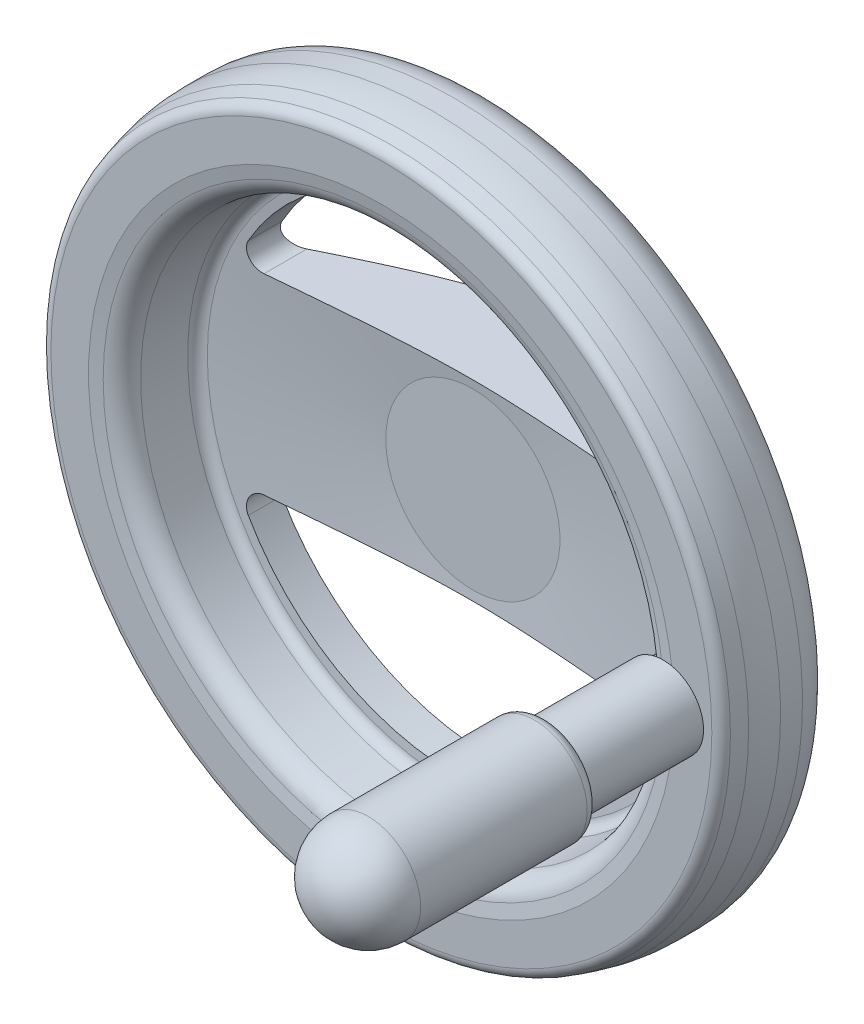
ISO-10303-21;
HEADER;
FILE_DESCRIPTION(('STEP AP214'),'2;1');
FILE_NAME('part.step','',(''),(''),'','','');
FILE_SCHEMA(('AUTOMOTIVE_DESIGN { 1 0 10303 214 1 1 1 1 }'));
ENDSEC;
DATA;
#1=APPLICATION_CONTEXT('core data for automotive mechanical design processes');
#2=APPLICATION_PROTOCOL_DEFINITION('international standard','automotive_design',2000,#1);
#3=PRODUCT_CONTEXT('',#1,'mechanical');
#4=PRODUCT('Part','Part','',(#3));
#5=PRODUCT_RELATED_PRODUCT_CATEGORY('part','',(#4));
#6=PRODUCT_DEFINITION_FORMATION('','',#4);
#7=PRODUCT_DEFINITION_CONTEXT('part definition',#1,'design');
#8=PRODUCT_DEFINITION('design','',#6,#7);
#9=PRODUCT_DEFINITION_SHAPE('','',#8);
#10=(LENGTH_UNIT() NAMED_UNIT(*) SI_UNIT(.MILLI.,.METRE.));
#11=(NAMED_UNIT(*) PLANE_ANGLE_UNIT() SI_UNIT($,.RADIAN.));
#12=(NAMED_UNIT(*) SI_UNIT($,.STERADIAN.) SOLID_ANGLE_UNIT());
#13=UNCERTAINTY_MEASURE_WITH_UNIT(LENGTH_MEASURE(1.E-05),#10,'distance_accuracy_value','');
#14=(GEOMETRIC_REPRESENTATION_CONTEXT(3) GLOBAL_UNCERTAINTY_ASSIGNED_CONTEXT((#13)) GLOBAL_UNIT_ASSIGNED_CONTEXT((#10,
#11,#12)) REPRESENTATION_CONTEXT('',''));
#15=CARTESIAN_POINT('',(0.,0.,0.));
#16=DIRECTION('',(0.,0.,1.));
#17=DIRECTION('',(1.,0.,0.));
#18=AXIS2_PLACEMENT_3D('',#15,#16,#17);
#19=CARTESIAN_POINT('',(-4.34375,0.,27.));
#20=DIRECTION('',(0.,0.,-1.));
#21=DIRECTION('',(0.,1.,0.));
#22=AXIS2_PLACEMENT_3D('',#19,#20,#21);
#23=PLANE('',#22);
#24=CARTESIAN_POINT('',(0.,0.,27.));
#25=DIRECTION('',(0.,0.,1.));
#26=DIRECTION('',(0.,-1.,0.));
#27=AXIS2_PLACEMENT_3D('',#24,#25,#26);
#28=CIRCLE('',#27,8.6875);
#29=CARTESIAN_POINT('',(0.,-8.6875,27.));
#30=VERTEX_POINT('',#29);
#31=EDGE_CURVE('E259',#30,#30,#28,.F.);
#32=ORIENTED_EDGE('',*,*,#31,.T.);
#33=EDGE_LOOP('',(#32));
#34=FACE_BOUND('',#33,.T.);
#35=ADVANCED_FACE('F14',(#34),#23,.T.);
#36=CARTESIAN_POINT('',(0.,0.,27.));
#37=DIRECTION('',(0.,0.,1.));
#38=DIRECTION('',(0.,-1.,0.));
#39=AXIS2_PLACEMENT_3D('',#36,#37,#38);
#40=CONICAL_SURFACE('',#39,8.6875,0.785398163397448);
#41=ORIENTED_EDGE('',*,*,#31,.F.);
#42=EDGE_LOOP('',(#41));
#43=FACE_BOUND('',#42,.T.);
#44=CARTESIAN_POINT('',(0.,0.,25.3125));
#45=DIRECTION('',(0.,0.,1.));
#46=DIRECTION('',(-1.,0.,0.));
#47=AXIS2_PLACEMENT_3D('',#44,#45,#46);
#48=CIRCLE('',#47,7.);
#49=CARTESIAN_POINT('',(-7.,0.,25.3125));
#50=VERTEX_POINT('',#49);
#51=EDGE_CURVE('E803',#50,#50,#48,.F.);
#52=ORIENTED_EDGE('',*,*,#51,.T.);
#53=EDGE_LOOP('',(#52));
#54=FACE_BOUND('',#53,.T.);
#55=ADVANCED_FACE('F225',(#43,#54),#40,.F.);
#56=CARTESIAN_POINT('',(0.,0.,12.75625));
#57=DIRECTION('',(0.,0.,1.));
#58=DIRECTION('',(-1.,0.,0.));
#59=AXIS2_PLACEMENT_3D('',#56,#57,#58);
#60=CYLINDRICAL_SURFACE('',#59,7.);
#61=ORIENTED_EDGE('',*,*,#51,.F.);
#62=EDGE_LOOP('',(#61));
#63=FACE_BOUND('',#62,.T.);
#64=CARTESIAN_POINT('',(0.,0.,0.2));
#65=DIRECTION('',(0.,0.,-1.));
#66=DIRECTION('',(-1.,0.,0.));
#67=AXIS2_PLACEMENT_3D('',#64,#65,#66);
#68=CIRCLE('',#67,7.);
#69=CARTESIAN_POINT('',(-7.,0.,0.2));
#70=VERTEX_POINT('',#69);
#71=EDGE_CURVE('E794',#70,#70,#68,.T.);
#72=ORIENTED_EDGE('',*,*,#71,.T.);
#73=EDGE_LOOP('',(#72));
#74=FACE_BOUND('',#73,.T.);
#75=ADVANCED_FACE('F221',(#63,#74),#60,.F.);
#76=CARTESIAN_POINT('',(0.,0.,0.));
#77=DIRECTION('',(0.,0.,-1.));
#78=DIRECTION('',(1.,0.,0.));
#79=AXIS2_PLACEMENT_3D('',#76,#77,#78);
#80=CONICAL_SURFACE('',#79,7.2,0.78539816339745);
#81=ORIENTED_EDGE('',*,*,#71,.F.);
#82=EDGE_LOOP('',(#81));
#83=FACE_BOUND('',#82,.T.);
#84=CARTESIAN_POINT('',(0.,0.,0.));
#85=DIRECTION('',(0.,0.,-1.));
#86=DIRECTION('',(1.,0.,0.));
#87=AXIS2_PLACEMENT_3D('',#84,#85,#86);
#88=CIRCLE('',#87,7.2);
#89=CARTESIAN_POINT('',(7.2,0.,0.));
#90=VERTEX_POINT('',#89);
#91=EDGE_CURVE('E802',#90,#90,#88,.F.);
#92=ORIENTED_EDGE('',*,*,#91,.F.);
#93=EDGE_LOOP('',(#92));
#94=FACE_BOUND('',#93,.T.);
#95=ADVANCED_FACE('F217',(#83,#94),#80,.F.);
#96=CARTESIAN_POINT('',(-10.1,0.,0.));
#97=DIRECTION('',(0.,0.,-1.));
#98=DIRECTION('',(0.,1.,0.));
#99=AXIS2_PLACEMENT_3D('',#96,#97,#98);
#100=PLANE('',#99);
#101=CARTESIAN_POINT('',(0.,0.,0.));
#102=DIRECTION('',(0.,0.,1.));
#103=DIRECTION('',(-1.,0.,0.));
#104=AXIS2_PLACEMENT_3D('',#101,#102,#103);
#105=CIRCLE('',#104,13.);
#106=CARTESIAN_POINT('',(-13.,0.,0.));
#107=VERTEX_POINT('',#106);
#108=EDGE_CURVE('E190',#107,#107,#105,.T.);
#109=ORIENTED_EDGE('',*,*,#108,.F.);
#110=EDGE_LOOP('',(#109));
#111=FACE_BOUND('',#110,.T.);
#112=ORIENTED_EDGE('',*,*,#91,.T.);
#113=EDGE_LOOP('',(#112));
#114=FACE_BOUND('',#113,.T.);
#115=ADVANCED_FACE('F213',(#111,#114),#100,.T.);
#116=CARTESIAN_POINT('',(0.,0.,0.1));
#117=DIRECTION('',(0.,0.,1.));
#118=DIRECTION('',(-1.,0.,0.));
#119=AXIS2_PLACEMENT_3D('',#116,#117,#118);
#120=CYLINDRICAL_SURFACE('',#119,13.);
#121=ORIENTED_EDGE('',*,*,#108,.T.);
#122=EDGE_LOOP('',(#121));
#123=FACE_BOUND('',#122,.T.);
#124=CARTESIAN_POINT('',(0.,0.,0.2));
#125=DIRECTION('',(0.,0.,1.));
#126=DIRECTION('',(-1.,0.,0.));
#127=AXIS2_PLACEMENT_3D('',#124,#125,#126);
#128=CIRCLE('',#127,13.);
#129=CARTESIAN_POINT('',(-13.,0.,0.2));
#130=VERTEX_POINT('',#129);
#131=EDGE_CURVE('E1194',#130,#130,#128,.T.);
#132=ORIENTED_EDGE('',*,*,#131,.F.);
#133=EDGE_LOOP('',(#132));
#134=FACE_BOUND('',#133,.T.);
#135=ADVANCED_FACE('F216',(#123,#134),#120,.T.);
#136=CARTESIAN_POINT('',(-16.25,0.,0.2));
#137=DIRECTION('',(0.,0.,-1.));
#138=DIRECTION('',(0.,1.,0.));
#139=AXIS2_PLACEMENT_3D('',#136,#137,#138);
#140=PLANE('',#139);
#141=CARTESIAN_POINT('',(0.,0.,0.2));
#142=DIRECTION('',(0.,0.,1.));
#143=DIRECTION('',(0.,-1.,0.));
#144=AXIS2_PLACEMENT_3D('',#141,#142,#143);
#145=CIRCLE('',#144,19.5);
#146=CARTESIAN_POINT('',(0.,-19.5,0.2));
#147=VERTEX_POINT('',#146);
#148=CARTESIAN_POINT('',(0.,19.5,0.2));
#149=VERTEX_POINT('',#148);
#150=EDGE_CURVE('E1149',#147,#149,#145,.T.);
#151=ORIENTED_EDGE('',*,*,#150,.F.);
#152=CARTESIAN_POINT('',(0.,0.,0.2));
#153=DIRECTION('',(0.,0.,1.));
#154=DIRECTION('',(-1.,0.,0.));
#155=AXIS2_PLACEMENT_3D('',#152,#153,#154);
#156=CIRCLE('',#155,19.5);
#157=CARTESIAN_POINT('',(-19.5,0.,0.2));
#158=VERTEX_POINT('',#157);
#159=EDGE_CURVE('E1069',#158,#147,#156,.T.);
#160=ORIENTED_EDGE('',*,*,#159,.F.);
#161=CARTESIAN_POINT('',(0.,0.,0.2));
#162=DIRECTION('',(0.,0.,1.));
#163=DIRECTION('',(0.,1.,0.));
#164=AXIS2_PLACEMENT_3D('',#161,#162,#163);
#165=CIRCLE('',#164,19.5);
#166=EDGE_CURVE('E1122',#149,#158,#165,.T.);
#167=ORIENTED_EDGE('',*,*,#166,.F.);
#168=EDGE_LOOP('',(#151,#160,#167));
#169=FACE_BOUND('',#168,.T.);
#170=ORIENTED_EDGE('',*,*,#131,.T.);
#171=EDGE_LOOP('',(#170));
#172=FACE_BOUND('',#171,.T.);
#173=ADVANCED_FACE('F660',(#169,#172),#140,.T.);
#174=CARTESIAN_POINT('',(0.,0.,0.7));
#175=DIRECTION('',(0.,0.,-1.));
#176=DIRECTION('',(0.,1.,0.));
#177=AXIS2_PLACEMENT_3D('',#174,#175,#176);
#178=TOROIDAL_SURFACE('',#177,19.5,0.5);
#179=CARTESIAN_POINT('',(0.,0.,0.7));
#180=DIRECTION('',(0.,0.,1.));
#181=DIRECTION('',(-1.,0.,0.));
#182=AXIS2_PLACEMENT_3D('',#179,#180,#181);
#183=CIRCLE('',#182,20.);
#184=CARTESIAN_POINT('',(-20.,0.,0.7));
#185=VERTEX_POINT('',#184);
#186=EDGE_CURVE('E1036',#185,#185,#183,.T.);
#187=ORIENTED_EDGE('',*,*,#186,.F.);
#188=EDGE_LOOP('',(#187));
#189=FACE_BOUND('',#188,.T.);
#190=ORIENTED_EDGE('',*,*,#150,.T.);
#191=ORIENTED_EDGE('',*,*,#166,.T.);
#192=ORIENTED_EDGE('',*,*,#159,.T.);
#193=EDGE_LOOP('',(#190,#191,#192));
#194=FACE_BOUND('',#193,.T.);
#195=ADVANCED_FACE('F650',(#189,#194),#178,.T.);
#196=CARTESIAN_POINT('',(0.,0.,3.725));
#197=DIRECTION('',(0.,0.,1.));
#198=DIRECTION('',(-1.,0.,0.));
#199=AXIS2_PLACEMENT_3D('',#196,#197,#198);
#200=CYLINDRICAL_SURFACE('',#199,20.);
#201=ORIENTED_EDGE('',*,*,#186,.T.);
#202=EDGE_LOOP('',(#201));
#203=FACE_BOUND('',#202,.T.);
#204=CARTESIAN_POINT('',(0.,0.,6.75));
#205=DIRECTION('',(0.,0.,1.));
#206=DIRECTION('',(-1.,0.,0.));
#207=AXIS2_PLACEMENT_3D('',#204,#205,#206);
#208=CIRCLE('',#207,20.);
#209=CARTESIAN_POINT('',(-20.,0.,6.75));
#210=VERTEX_POINT('',#209);
#211=EDGE_CURVE('E1426',#210,#210,#208,.T.);
#212=ORIENTED_EDGE('',*,*,#211,.F.);
#213=EDGE_LOOP('',(#212));
#214=FACE_BOUND('',#213,.T.);
#215=ADVANCED_FACE('F640',(#203,#214),#200,.T.);
#216=CARTESIAN_POINT('',(0.,0.,21.));
#217=DIRECTION('',(0.,0.,-1.));
#218=DIRECTION('',(0.,1.,0.));
#219=AXIS2_PLACEMENT_3D('',#216,#217,#218);
#220=TOROIDAL_SURFACE('',#219,56.2438135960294,5.);
#221=CARTESIAN_POINT('',(0.,0.,25.8838614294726));
#222=DIRECTION('',(0.,0.,-1.));
#223=DIRECTION('',(0.,1.,0.));
#224=AXIS2_PLACEMENT_3D('',#221,#222,#223);
#225=CIRCLE('',#224,55.1724137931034);
#226=CARTESIAN_POINT('',(-47.9357497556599,27.315913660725,25.8838614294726));
#227=VERTEX_POINT('',#226);
#228=CARTESIAN_POINT('',(47.9357492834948,27.3159144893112,25.8838614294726));
#229=VERTEX_POINT('',#228);
#230=EDGE_CURVE('E851',#227,#229,#225,.T.);
#231=ORIENTED_EDGE('',*,*,#230,.F.);
#232=CARTESIAN_POINT('',(-48.1117799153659,24.1483271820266,25.3798622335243));
#233=CARTESIAN_POINT('',(-48.1453075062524,24.226058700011,25.4155722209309));
#234=CARTESIAN_POINT('',(-48.1764266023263,24.305965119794,25.4487865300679));
#235=CARTESIAN_POINT('',(-48.2332496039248,24.4694059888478,25.5105013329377));
#236=CARTESIAN_POINT('',(-48.2589553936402,24.5529391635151,25.5390034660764));
#237=CARTESIAN_POINT('',(-48.3042755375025,24.7225842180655,25.5914775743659));
#238=CARTESIAN_POINT('',(-48.3239167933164,24.808682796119,25.6154693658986));
#239=CARTESIAN_POINT('',(-48.3568455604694,24.9830878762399,25.6594549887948));
#240=CARTESIAN_POINT('',(-48.370132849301,25.0713944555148,25.6794486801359));
#241=CARTESIAN_POINT('',(-48.390042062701,25.2494390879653,25.715831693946));
#242=CARTESIAN_POINT('',(-48.396667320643,25.3391764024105,25.7322228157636));
#243=CARTESIAN_POINT('',(-48.4030733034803,25.5194539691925,25.7618353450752));
#244=CARTESIAN_POINT('',(-48.4028509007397,25.6099945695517,25.7750553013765));
#245=CARTESIAN_POINT('',(-48.3954524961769,25.7912408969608,25.7987294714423));
#246=CARTESIAN_POINT('',(-48.3882697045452,25.8819466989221,25.8091809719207));
#247=CARTESIAN_POINT('',(-48.3669240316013,26.0627820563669,25.8276721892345));
#248=CARTESIAN_POINT('',(-48.352760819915,26.1529115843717,25.8357117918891));
#249=CARTESIAN_POINT('',(-48.3166540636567,26.3362902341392,25.8500403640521));
#250=CARTESIAN_POINT('',(-48.2943681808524,26.4294801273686,25.8562261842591));
#251=CARTESIAN_POINT('',(-48.242309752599,26.6138632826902,25.8666057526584));
#252=CARTESIAN_POINT('',(-48.2125366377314,26.7050563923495,25.8707993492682));
#253=CARTESIAN_POINT('',(-48.1456825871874,26.8848168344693,25.8774230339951));
#254=CARTESIAN_POINT('',(-48.108599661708,26.9733834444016,25.8798526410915));
#255=CARTESIAN_POINT('',(-48.0273918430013,27.1472490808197,25.8830636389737));
#256=CARTESIAN_POINT('',(-47.9832675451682,27.2325483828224,25.8838451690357));
#257=CARTESIAN_POINT('',(-47.9357497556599,27.315913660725,25.8838614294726));
#258=B_SPLINE_CURVE_WITH_KNOTS('',3,(#232,#233,#234,#235,#236,#237,#238,#239,#240,#241,#242,
#243,#244,#245,#246,#247,#248,#249,#250,#251,#252,#253,#254,#255,#256,#257),.UNSPECIFIED.,.F.,
.F.,(4,2,2,2,2,2,2,2,2,2,2,2,4),(0.,0.275531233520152,0.550966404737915,0.825161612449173,
1.09936642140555,1.37343396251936,1.64762668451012,1.92208714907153,2.19656060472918,
2.48427355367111,2.77200839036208,3.05982165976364,3.34761060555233),.UNSPECIFIED.);
#259=CARTESIAN_POINT('',(-48.1117799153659,24.1483271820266,25.3798622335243));
#260=VERTEX_POINT('',#259);
#261=EDGE_CURVE('E854',#260,#227,#258,.T.);
#262=ORIENTED_EDGE('',*,*,#261,.F.);
#263=CARTESIAN_POINT('',(0.,0.,25.3798622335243));
#264=DIRECTION('',(0.,0.,-1.));
#265=DIRECTION('',(0.,1.,0.));
#266=AXIS2_PLACEMENT_3D('',#263,#264,#265);
#267=CIRCLE('',#266,53.8320078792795);
#268=CARTESIAN_POINT('',(-48.1117799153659,-24.1483271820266,25.3798622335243));
#269=VERTEX_POINT('',#268);
#270=EDGE_CURVE('E874',#269,#260,#267,.T.);
#271=ORIENTED_EDGE('',*,*,#270,.F.);
#272=CARTESIAN_POINT('',(-47.9357492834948,-27.3159144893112,25.8838614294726));
#273=CARTESIAN_POINT('',(-47.9836189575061,-27.231932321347,25.8838446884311));
#274=CARTESIAN_POINT('',(-48.0280444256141,-27.1459874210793,25.8830517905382));
#275=CARTESIAN_POINT('',(-48.109746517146,-26.9707898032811,25.8797928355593));
#276=CARTESIAN_POINT('',(-48.1470227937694,-26.8815369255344,25.8773266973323));
#277=CARTESIAN_POINT('',(-48.2141706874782,-26.7003241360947,25.8705994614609));
#278=CARTESIAN_POINT('',(-48.2440402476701,-26.6083634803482,25.8663378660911));
#279=CARTESIAN_POINT('',(-48.2961696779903,-26.4224263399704,25.8557844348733));
#280=CARTESIAN_POINT('',(-48.3184298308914,-26.3284499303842,25.849492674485));
#281=CARTESIAN_POINT('',(-48.3552449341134,-26.1390019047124,25.834553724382));
#282=CARTESIAN_POINT('',(-48.3697856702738,-26.043527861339,25.8259022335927));
#283=CARTESIAN_POINT('',(-48.3910423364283,-25.8519985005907,25.80586135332));
#284=CARTESIAN_POINT('',(-48.3977585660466,-25.7559432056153,25.7944720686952));
#285=CARTESIAN_POINT('',(-48.4033942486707,-25.564148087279,25.7685260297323));
#286=CARTESIAN_POINT('',(-48.4023231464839,-25.4684080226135,25.7539731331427));
#287=CARTESIAN_POINT('',(-48.3925425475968,-25.2779958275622,25.7212186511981));
#288=CARTESIAN_POINT('',(-48.3838373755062,-25.1833231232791,25.7030191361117));
#289=CARTESIAN_POINT('',(-48.3605016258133,-25.0067908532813,25.6648431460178));
#290=CARTESIAN_POINT('',(-48.3466806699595,-24.9247248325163,25.645321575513));
#291=CARTESIAN_POINT('',(-48.3135612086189,-24.7626525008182,25.6027230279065));
#292=CARTESIAN_POINT('',(-48.2942633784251,-24.6826459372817,25.5796464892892));
#293=CARTESIAN_POINT('',(-48.2504715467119,-24.5249999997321,25.5295518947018));
#294=CARTESIAN_POINT('',(-48.2259594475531,-24.4473699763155,25.5025202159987));
#295=CARTESIAN_POINT('',(-48.1722568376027,-24.2953043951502,25.4443374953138));
#296=CARTESIAN_POINT('',(-48.1430646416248,-24.2208700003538,25.4131849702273));
#297=CARTESIAN_POINT('',(-48.1117799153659,-24.1483271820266,25.3798622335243));
#298=B_SPLINE_CURVE_WITH_KNOTS('',3,(#272,#273,#274,#275,#276,#277,#278,#279,#280,#281,#282,
#283,#284,#285,#286,#287,#288,#289,#290,#291,#292,#293,#294,#295,#296,#297),.UNSPECIFIED.,.F.,
.F.,(4,2,2,2,2,2,2,2,2,2,2,2,4),(0.,0.289917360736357,0.579848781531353,0.86986062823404,
1.15986169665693,1.45039492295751,1.74091702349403,2.03108682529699,2.3210923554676,
2.57726983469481,2.83341574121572,3.09046562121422,3.34760826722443),.UNSPECIFIED.);
#299=CARTESIAN_POINT('',(-47.9357492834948,-27.3159144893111,25.8838614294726));
#300=VERTEX_POINT('',#299);
#301=EDGE_CURVE('E877',#300,#269,#298,.T.);
#302=ORIENTED_EDGE('',*,*,#301,.F.);
#303=CARTESIAN_POINT('',(0.,0.,25.8838614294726));
#304=DIRECTION('',(0.,0.,-1.));
#305=DIRECTION('',(0.,1.,0.));
#306=AXIS2_PLACEMENT_3D('',#303,#304,#305);
#307=CIRCLE('',#306,55.1724137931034);
#308=CARTESIAN_POINT('',(47.9357492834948,-27.3159144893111,25.8838614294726));
#309=VERTEX_POINT('',#308);
#310=EDGE_CURVE('E818',#309,#300,#307,.T.);
#311=ORIENTED_EDGE('',*,*,#310,.F.);
#312=CARTESIAN_POINT('',(48.1117799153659,-24.1483271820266,25.3798622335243));
#313=CARTESIAN_POINT('',(48.1453075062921,-24.2260587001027,25.4155722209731));
#314=CARTESIAN_POINT('',(48.1764266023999,-24.3059651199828,25.4487865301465));
#315=CARTESIAN_POINT('',(48.2332496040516,-24.4694059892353,25.5105013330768));
#316=CARTESIAN_POINT('',(48.2589553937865,-24.5529391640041,25.53900346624));
#317=CARTESIAN_POINT('',(48.3042755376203,-24.7225842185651,25.5914775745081));
#318=CARTESIAN_POINT('',(48.3239167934,-24.8086827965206,25.6154693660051));
#319=CARTESIAN_POINT('',(48.3568455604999,-24.9830878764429,25.6594549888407));
#320=CARTESIAN_POINT('',(48.3701328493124,-25.071394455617,25.6794486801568));
#321=CARTESIAN_POINT('',(48.3900420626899,-25.2494390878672,25.715831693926));
#322=CARTESIAN_POINT('',(48.3966673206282,-25.3391764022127,25.7322228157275));
#323=CARTESIAN_POINT('',(48.4030733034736,-25.5194539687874,25.7618353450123));
#324=CARTESIAN_POINT('',(48.4028509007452,-25.6099945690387,25.7750553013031));
#325=CARTESIAN_POINT('',(48.3954524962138,-25.7912408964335,25.7987294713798));
#326=CARTESIAN_POINT('',(48.3882697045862,-25.8819466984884,25.8091809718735));
#327=CARTESIAN_POINT('',(48.3669240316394,-26.0627820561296,25.827672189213));
#328=CARTESIAN_POINT('',(48.3527608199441,-26.1529115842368,25.8357117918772));
#329=CARTESIAN_POINT('',(48.316654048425,-26.3362903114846,25.850040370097));
#330=CARTESIAN_POINT('',(48.2943681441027,-26.4294802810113,25.8562261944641));
#331=CARTESIAN_POINT('',(48.2423096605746,-26.613863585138,25.8666057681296));
#332=CARTESIAN_POINT('',(48.2125365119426,-26.705056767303,25.8707993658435));
#333=CARTESIAN_POINT('',(48.1456823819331,-26.8848173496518,25.8774230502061));
#334=CARTESIAN_POINT('',(48.1085994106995,-26.973384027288,25.8798526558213));
#335=CARTESIAN_POINT('',(48.0273914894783,-27.1472497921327,25.8830636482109));
#336=CARTESIAN_POINT('',(47.983267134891,-27.2325491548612,25.883845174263));
#337=CARTESIAN_POINT('',(47.9357492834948,-27.3159144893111,25.8838614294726));
#338=B_SPLINE_CURVE_WITH_KNOTS('',3,(#312,#313,#314,#315,#316,#317,#318,#319,#320,#321,#322,
#323,#324,#325,#326,#327,#328,#329,#330,#331,#332,#333,#334,#335,#336,#337),.UNSPECIFIED.,.F.,
.F.,(4,2,2,2,2,2,2,2,2,2,2,2,4),(0.,0.275531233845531,0.550966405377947,0.825161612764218,
1.09936642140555,1.37343396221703,1.6476266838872,1.9220871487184,2.19656060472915,
2.48427379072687,2.77200886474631,3.05982237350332,3.34761155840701),.UNSPECIFIED.);
#339=CARTESIAN_POINT('',(48.1117799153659,-24.1483271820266,25.3798622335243));
#340=VERTEX_POINT('',#339);
#341=EDGE_CURVE('E811',#340,#309,#338,.T.);
#342=ORIENTED_EDGE('',*,*,#341,.F.);
#343=CARTESIAN_POINT('',(0.,0.,25.3798622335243));
#344=DIRECTION('',(0.,0.,-1.));
#345=DIRECTION('',(0.,1.,0.));
#346=AXIS2_PLACEMENT_3D('',#343,#344,#345);
#347=CIRCLE('',#346,53.8320078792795);
#348=CARTESIAN_POINT('',(48.1117799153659,24.1483271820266,25.3798622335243));
#349=VERTEX_POINT('',#348);
#350=EDGE_CURVE('E819',#349,#340,#347,.T.);
#351=ORIENTED_EDGE('',*,*,#350,.F.);
#352=CARTESIAN_POINT('',(47.9357492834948,27.3159144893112,25.8838614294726));
#353=CARTESIAN_POINT('',(47.9836189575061,27.231932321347,25.8838446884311));
#354=CARTESIAN_POINT('',(48.0280444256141,27.1459874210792,25.8830517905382));
#355=CARTESIAN_POINT('',(48.109746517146,26.9707898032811,25.8797928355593));
#356=CARTESIAN_POINT('',(48.1470227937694,26.8815369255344,25.8773266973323));
#357=CARTESIAN_POINT('',(48.2141706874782,26.7003241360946,25.8705994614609));
#358=CARTESIAN_POINT('',(48.2440402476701,26.6083634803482,25.8663378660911));
#359=CARTESIAN_POINT('',(48.2961696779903,26.4224263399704,25.8557844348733));
#360=CARTESIAN_POINT('',(48.3184298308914,26.3284499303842,25.849492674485));
#361=CARTESIAN_POINT('',(48.3552449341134,26.1390019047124,25.834553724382));
#362=CARTESIAN_POINT('',(48.3697856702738,26.043527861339,25.8259022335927));
#363=CARTESIAN_POINT('',(48.3910423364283,25.8519985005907,25.80586135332));
#364=CARTESIAN_POINT('',(48.3977585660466,25.7559432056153,25.7944720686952));
#365=CARTESIAN_POINT('',(48.4033942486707,25.564148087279,25.7685260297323));
#366=CARTESIAN_POINT('',(48.4023231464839,25.4684080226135,25.7539731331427));
#367=CARTESIAN_POINT('',(48.3925425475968,25.2779958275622,25.7212186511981));
#368=CARTESIAN_POINT('',(48.3838373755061,25.1833231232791,25.7030191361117));
#369=CARTESIAN_POINT('',(48.3605016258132,25.0067908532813,25.6648431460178));
#370=CARTESIAN_POINT('',(48.3466806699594,24.9247248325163,25.6453215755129));
#371=CARTESIAN_POINT('',(48.3135612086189,24.7626525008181,25.6027230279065));
#372=CARTESIAN_POINT('',(48.2942633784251,24.6826459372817,25.5796464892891));
#373=CARTESIAN_POINT('',(48.2504715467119,24.5249999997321,25.5295518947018));
#374=CARTESIAN_POINT('',(48.225959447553,24.4473699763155,25.5025202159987));
#375=CARTESIAN_POINT('',(48.1722568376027,24.2953043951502,25.4443374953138));
#376=CARTESIAN_POINT('',(48.1430646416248,24.2208700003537,25.4131849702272));
#377=CARTESIAN_POINT('',(48.1117799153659,24.1483271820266,25.3798622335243));
#378=B_SPLINE_CURVE_WITH_KNOTS('',3,(#352,#353,#354,#355,#356,#357,#358,#359,#360,#361,#362,
#363,#364,#365,#366,#367,#368,#369,#370,#371,#372,#373,#374,#375,#376,#377),.UNSPECIFIED.,.F.,
.F.,(4,2,2,2,2,2,2,2,2,2,2,2,4),(0.,0.289917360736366,0.579848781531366,0.869860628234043,
1.15986169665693,1.4503949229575,1.74091702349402,2.03108682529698,2.32109235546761,
2.57726983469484,2.83341574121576,3.09046562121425,3.34760826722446),.UNSPECIFIED.);
#379=EDGE_CURVE('E820',#229,#349,#378,.T.);
#380=ORIENTED_EDGE('',*,*,#379,.F.);
#381=EDGE_LOOP('',(#231,#262,#271,#302,#311,#342,#351,#380));
#382=FACE_BOUND('',#381,.T.);
#383=CARTESIAN_POINT('',(0.,0.,26.));
#384=DIRECTION('',(0.,0.,-1.));
#385=DIRECTION('',(-1.,0.,0.));
#386=AXIS2_PLACEMENT_3D('',#383,#384,#385);
#387=CIRCLE('',#386,56.2438135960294);
#388=CARTESIAN_POINT('',(0.,56.2438135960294,26.));
#389=VERTEX_POINT('',#388);
#390=CARTESIAN_POINT('',(-56.2438135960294,0.,26.));
#391=VERTEX_POINT('',#390);
#392=EDGE_CURVE('E809',#389,#391,#387,.F.);
#393=ORIENTED_EDGE('',*,*,#392,.F.);
#394=CARTESIAN_POINT('',(0.,0.,26.));
#395=DIRECTION('',(0.,0.,-1.));
#396=DIRECTION('',(0.,1.,0.));
#397=AXIS2_PLACEMENT_3D('',#394,#395,#396);
#398=CIRCLE('',#397,56.2438135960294);
#399=CARTESIAN_POINT('',(0.,-56.2438135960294,26.));
#400=VERTEX_POINT('',#399);
#401=EDGE_CURVE('E863',#400,#389,#398,.F.);
#402=ORIENTED_EDGE('',*,*,#401,.F.);
#403=CARTESIAN_POINT('',(0.,0.,26.));
#404=DIRECTION('',(0.,0.,-1.));
#405=DIRECTION('',(0.,-1.,0.));
#406=AXIS2_PLACEMENT_3D('',#403,#404,#405);
#407=CIRCLE('',#406,56.2438135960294);
#408=EDGE_CURVE('E1365',#391,#400,#407,.F.);
#409=ORIENTED_EDGE('',*,*,#408,.F.);
#410=EDGE_LOOP('',(#393,#402,#409));
#411=FACE_BOUND('',#410,.T.);
#412=ADVANCED_FACE('F631',(#382,#411),#220,.F.);
#413=CARTESIAN_POINT('',(0.,0.,25.3798622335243));
#414=DIRECTION('',(0.,0.,1.));
#415=DIRECTION('',(-1.,0.,0.));
#416=AXIS2_PLACEMENT_3D('',#413,#414,#415);
#417=CONICAL_SURFACE('',#416,53.8320078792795,1.06744815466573);
#418=ORIENTED_EDGE('',*,*,#211,.T.);
#419=EDGE_LOOP('',(#418));
#420=FACE_BOUND('',#419,.T.);
#421=CARTESIAN_POINT('',(-44.8465565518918,-22.,23.2433677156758));
#422=CARTESIAN_POINT('',(-45.0748243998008,-21.9999944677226,23.3562492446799));
#423=CARTESIAN_POINT('',(-45.3006653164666,-22.021963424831,23.4733627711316));
#424=CARTESIAN_POINT('',(-45.7417829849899,-22.1072284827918,23.7124055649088));
#425=CARTESIAN_POINT('',(-45.9570603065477,-22.1705223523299,23.8343345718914));
#426=CARTESIAN_POINT('',(-46.3711994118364,-22.3357493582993,24.0792743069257));
#427=CARTESIAN_POINT('',(-46.5700742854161,-22.4376513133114,24.202284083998));
#428=CARTESIAN_POINT('',(-46.9461855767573,-22.6775069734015,24.4462079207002));
#429=CARTESIAN_POINT('',(-47.1234378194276,-22.8154340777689,24.5671234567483));
#430=CARTESIAN_POINT('',(-47.3730065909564,-23.0509474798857,24.7474043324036));
#431=CARTESIAN_POINT('',(-47.4552654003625,-23.1367052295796,24.8088004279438));
#432=CARTESIAN_POINT('',(-47.6114038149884,-23.3168533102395,24.9296016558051));
#433=CARTESIAN_POINT('',(-47.6852845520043,-23.4112424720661,24.9890070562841));
#434=CARTESIAN_POINT('',(-47.8240221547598,-23.6084393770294,25.1055093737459));
#435=CARTESIAN_POINT('',(-47.8888434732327,-23.7112779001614,25.1625966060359));
#436=CARTESIAN_POINT('',(-48.0082452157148,-23.9244068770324,25.2736931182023));
#437=CARTESIAN_POINT('',(-48.0628183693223,-24.0347025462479,25.3277001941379));
#438=CARTESIAN_POINT('',(-48.1117799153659,-24.1483271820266,25.3798622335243));
#439=B_SPLINE_CURVE_WITH_KNOTS('',3,(#421,#422,#423,#424,#425,#426,#427,#428,#429,#430,#431,
#432,#433,#434,#435,#436,#437,#438),.UNSPECIFIED.,.F.,.F.,(4,2,2,2,2,2,2,2,4),(0.,
0.762575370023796,1.52510956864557,2.28702922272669,3.04838786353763,3.44918961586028,
3.84993715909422,4.25221547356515,4.65477810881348),.UNSPECIFIED.);
#440=CARTESIAN_POINT('',(-44.8465565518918,-22.,23.2433677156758));
#441=VERTEX_POINT('',#440);
#442=EDGE_CURVE('E979',#441,#269,#439,.T.);
#443=ORIENTED_EDGE('',*,*,#442,.T.);
#444=ORIENTED_EDGE('',*,*,#270,.T.);
#445=CARTESIAN_POINT('',(-48.1117799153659,24.1483271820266,25.3798622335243));
#446=CARTESIAN_POINT('',(-48.0676828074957,24.0460190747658,25.3328888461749));
#447=CARTESIAN_POINT('',(-48.0190665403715,23.9464352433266,25.2844416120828));
#448=CARTESIAN_POINT('',(-47.9134424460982,23.7532479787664,25.1849985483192));
#449=CARTESIAN_POINT('',(-47.8564394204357,23.6596411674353,25.1340041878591));
#450=CARTESIAN_POINT('',(-47.674274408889,23.3892123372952,24.978176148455));
#451=CARTESIAN_POINT('',(-47.5375553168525,23.221869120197,24.8700754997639));
#452=CARTESIAN_POINT('',(-47.238989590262,22.9166549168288,24.6486892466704));
#453=CARTESIAN_POINT('',(-47.0771958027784,22.7787233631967,24.5354148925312));
#454=CARTESIAN_POINT('',(-46.7327228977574,22.5341282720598,24.3060280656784));
#455=CARTESIAN_POINT('',(-46.5500077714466,22.4275198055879,24.1899109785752));
#456=CARTESIAN_POINT('',(-46.1552260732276,22.2419104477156,23.9497037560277));
#457=CARTESIAN_POINT('',(-45.9420006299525,22.1653596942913,23.8256235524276));
#458=CARTESIAN_POINT('',(-45.5033007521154,22.0538911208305,23.5814200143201));
#459=CARTESIAN_POINT('',(-45.2778610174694,22.0188612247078,23.4612868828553));
#460=CARTESIAN_POINT('',(-44.9820626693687,22.001938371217,23.310844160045));
#461=CARTESIAN_POINT('',(-44.9143937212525,21.9999952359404,23.2769047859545));
#462=CARTESIAN_POINT('',(-44.8465565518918,22.,23.2433677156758));
#463=B_SPLINE_CURVE_WITH_KNOTS('',3,(#445,#446,#447,#448,#449,#450,#451,#452,#453,#454,#455,
#456,#457,#458,#459,#460,#461,#462),.UNSPECIFIED.,.F.,.F.,(4,2,2,2,2,2,2,2,4),(0.,
0.362439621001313,0.724672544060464,1.44593352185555,2.16569454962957,2.88671356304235,
3.65812295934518,4.42744533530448,4.65452461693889),.UNSPECIFIED.);
#464=CARTESIAN_POINT('',(-44.8465565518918,22.,23.2433677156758));
#465=VERTEX_POINT('',#464);
#466=EDGE_CURVE('E1009',#260,#465,#463,.T.);
#467=ORIENTED_EDGE('',*,*,#466,.T.);
#468=CARTESIAN_POINT('',(-44.8465565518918,22.,23.2433677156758));
#469=CARTESIAN_POINT('',(-44.302580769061,22.,22.9744421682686));
#470=CARTESIAN_POINT('',(-43.7582304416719,22.,22.7062743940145));
#471=CARTESIAN_POINT('',(-42.6687043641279,22.,22.1716167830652));
#472=CARTESIAN_POINT('',(-42.12352861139,22.,21.9051269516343));
#473=CARTESIAN_POINT('',(-40.4866004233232,22.,21.1083944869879));
#474=CARTESIAN_POINT('',(-39.3935002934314,22.,20.5809152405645));
#475=CARTESIAN_POINT('',(-37.2010187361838,22.,19.5340373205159));
#476=CARTESIAN_POINT('',(-36.1016295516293,22.,19.0146548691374));
#477=CARTESIAN_POINT('',(-33.8976257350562,22.,17.9871354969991));
#478=CARTESIAN_POINT('',(-32.79301119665,22.,17.4789983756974));
#479=CARTESIAN_POINT('',(-30.5168256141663,22.,16.4494243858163));
#480=CARTESIAN_POINT('',(-29.3448950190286,22.,15.9287787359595));
#481=CARTESIAN_POINT('',(-27.580358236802,22.,15.1630172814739));
#482=CARTESIAN_POINT('',(-26.9910528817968,22.,14.9102898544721));
#483=CARTESIAN_POINT('',(-25.8099813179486,22.,14.4106575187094));
#484=CARTESIAN_POINT('',(-25.2182151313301,22.,14.1637525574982));
#485=CARTESIAN_POINT('',(-24.0322704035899,22.,13.6767494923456));
#486=CARTESIAN_POINT('',(-23.4380933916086,22.,13.4366476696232));
#487=CARTESIAN_POINT('',(-22.2467009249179,22.,12.9641188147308));
#488=CARTESIAN_POINT('',(-21.6494855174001,22.,12.731691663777));
#489=CARTESIAN_POINT('',(-20.4517254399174,22.,12.2757108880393));
#490=CARTESIAN_POINT('',(-19.8511810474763,22.,12.0521565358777));
#491=CARTESIAN_POINT('',(-18.6463842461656,22.,11.6153002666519));
#492=CARTESIAN_POINT('',(-18.0421319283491,22.,11.4019980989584));
#493=CARTESIAN_POINT('',(-16.7421458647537,22.,10.9573666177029));
#494=CARTESIAN_POINT('',(-16.0457817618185,22.,10.7278713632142));
#495=CARTESIAN_POINT('',(-14.6472357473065,22.,10.2872685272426));
#496=CARTESIAN_POINT('',(-13.9450538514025,22.,10.0761608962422));
#497=CARTESIAN_POINT('',(-12.5344350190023,22.,9.67563362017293));
#498=CARTESIAN_POINT('',(-11.8259975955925,22.,9.486215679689));
#499=CARTESIAN_POINT('',(-10.4027608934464,22.,9.1328234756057));
#500=CARTESIAN_POINT('',(-9.68796164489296,22.,8.96884909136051));
#501=CARTESIAN_POINT('',(-8.26627958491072,22.,8.67328138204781));
#502=CARTESIAN_POINT('',(-7.55951673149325,22.,8.54111570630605));
#503=CARTESIAN_POINT('',(-6.14070283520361,22.,8.30885368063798));
#504=CARTESIAN_POINT('',(-5.42865189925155,22.,8.20875668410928));
#505=CARTESIAN_POINT('',(-4.00081515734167,22.,8.04401178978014));
#506=CARTESIAN_POINT('',(-3.28503164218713,22.,7.97934425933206));
#507=CARTESIAN_POINT('',(-1.8510334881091,22.,7.88779582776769));
#508=CARTESIAN_POINT('',(-1.13281888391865,22.,7.86091438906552));
#509=CARTESIAN_POINT('',(0.310706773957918,22.,7.84594577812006));
#510=CARTESIAN_POINT('',(1.03602166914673,22.,7.85822195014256));
#511=CARTESIAN_POINT('',(2.4849226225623,22.,7.92186007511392));
#512=CARTESIAN_POINT('',(3.20850865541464,22.,7.97322259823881));
#513=CARTESIAN_POINT('',(4.6524264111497,22.,8.1130480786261));
#514=CARTESIAN_POINT('',(5.37275623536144,22.,8.20153041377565));
#515=CARTESIAN_POINT('',(6.8083904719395,22.,8.41244788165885));
#516=CARTESIAN_POINT('',(7.52369476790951,22.,8.53488379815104));
#517=CARTESIAN_POINT('',(8.96279910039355,22.,8.81271597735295));
#518=CARTESIAN_POINT('',(9.68647932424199,22.,8.9687274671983));
#519=CARTESIAN_POINT('',(11.1273742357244,22.,9.30800845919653));
#520=CARTESIAN_POINT('',(11.8445888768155,22.,9.49127815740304));
#521=CARTESIAN_POINT('',(13.2726191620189,22.,9.88111829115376));
#522=CARTESIAN_POINT('',(13.9834347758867,22.,10.0876888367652));
#523=CARTESIAN_POINT('',(15.3990000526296,22.,10.5205728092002));
#524=CARTESIAN_POINT('',(16.1037496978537,22.,10.7468862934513));
#525=CARTESIAN_POINT('',(17.4273652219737,22.,11.1893378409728));
#526=CARTESIAN_POINT('',(18.0468348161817,22.,11.403679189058));
#527=CARTESIAN_POINT('',(19.2817777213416,22.,11.8436112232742));
#528=CARTESIAN_POINT('',(19.8972509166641,22.,12.0692022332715));
#529=CARTESIAN_POINT('',(21.1246227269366,22.,12.5300861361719));
#530=CARTESIAN_POINT('',(21.7365209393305,22.,12.7653800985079));
#531=CARTESIAN_POINT('',(22.9570290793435,22.,13.2443162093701));
#532=CARTESIAN_POINT('',(23.5656390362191,22.,13.4879582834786));
#533=CARTESIAN_POINT('',(24.7802933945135,22.,13.9826211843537));
#534=CARTESIAN_POINT('',(25.3863359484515,22.,14.2336465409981));
#535=CARTESIAN_POINT('',(26.5957809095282,22.,14.7419849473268));
#536=CARTESIAN_POINT('',(27.1991832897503,22.,14.9992980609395));
#537=CARTESIAN_POINT('',(29.0057647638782,22.,15.779384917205));
#538=CARTESIAN_POINT('',(30.2054116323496,22.,16.3103445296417));
#539=CARTESIAN_POINT('',(32.5334532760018,22.,17.3602786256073));
#540=CARTESIAN_POINT('',(33.6622410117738,22.,17.8783861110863));
#541=CARTESIAN_POINT('',(35.9142986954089,22.,18.9265011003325));
#542=CARTESIAN_POINT('',(37.0375685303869,22.,19.4565088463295));
#543=CARTESIAN_POINT('',(39.2772897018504,22.,20.5249715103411));
#544=CARTESIAN_POINT('',(40.3937502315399,22.,21.063407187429));
#545=CARTESIAN_POINT('',(42.0655890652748,22.,21.8768333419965));
#546=CARTESIAN_POINT('',(42.6223782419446,22.,22.1489300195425));
#547=CARTESIAN_POINT('',(43.7350939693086,22.,22.6948770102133));
#548=CARTESIAN_POINT('',(44.2910205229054,22.,22.9687273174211));
#549=CARTESIAN_POINT('',(44.8465565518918,22.,23.2433677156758));
#550=B_SPLINE_CURVE_WITH_KNOTS('',3,(#468,#469,#470,#471,#472,#473,#474,#475,#476,#477,#478,
#479,#480,#481,#482,#483,#484,#485,#486,#487,#488,#489,#490,#491,#492,#493,#494,#495,#496,#497,
#498,#499,#500,#501,#502,#503,#504,#505,#506,#507,#508,#509,#510,#511,#512,#513,#514,#515,#516,
#517,#518,#519,#520,#521,#522,#523,#524,#525,#526,#527,#528,#529,#530,#531,#532,#533,#534,#535,
#536,#537,#538,#539,#540,#541,#542,#543,#544,#545,#546,#547,#548,#549),.UNSPECIFIED.,.F.,.F.,(4,
2,2,2,2,2,2,2,2,2,2,2,2,2,2,2,2,2,2,2,2,2,2,2,2,2,2,2,2,2,2,2,2,2,2,2,2,2,2,2,4),(0.,
1.82045919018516,3.64092408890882,7.28203209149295,10.9296824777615,14.5772677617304,
18.424231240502,20.3478403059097,22.27143203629,24.1939511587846,26.1164405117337,
28.0387719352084,29.961056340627,32.1604565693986,34.3598508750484,36.5594179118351,
38.7589745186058,40.9153626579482,43.0717073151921,45.226855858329,47.3819737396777,
49.5571469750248,51.7323519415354,53.9086938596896,56.085086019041,58.3053936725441,
60.5257172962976,62.7460514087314,64.9663919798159,66.9327823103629,68.8992292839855,
70.8658935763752,72.832540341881,74.800419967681,76.7683196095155,80.7038159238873,
84.4297791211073,88.155818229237,91.8743254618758,93.7334779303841,95.5926241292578),.UNSPECIFIED.);
#551=CARTESIAN_POINT('',(44.8465565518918,22.,23.2433677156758));
#552=VERTEX_POINT('',#551);
#553=EDGE_CURVE('E1014',#465,#552,#550,.T.);
#554=ORIENTED_EDGE('',*,*,#553,.T.);
#555=CARTESIAN_POINT('',(44.8465565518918,22.,23.2433677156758));
#556=CARTESIAN_POINT('',(45.0748243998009,21.9999944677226,23.3562492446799));
#557=CARTESIAN_POINT('',(45.3006653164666,22.021963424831,23.4733627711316));
#558=CARTESIAN_POINT('',(45.7417829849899,22.1072284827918,23.7124055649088));
#559=CARTESIAN_POINT('',(45.9570603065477,22.1705223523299,23.8343345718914));
#560=CARTESIAN_POINT('',(46.3711994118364,22.3357493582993,24.0792743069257));
#561=CARTESIAN_POINT('',(46.5700742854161,22.4376513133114,24.202284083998));
#562=CARTESIAN_POINT('',(46.9461855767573,22.6775069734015,24.4462079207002));
#563=CARTESIAN_POINT('',(47.1234378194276,22.8154340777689,24.5671234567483));
#564=CARTESIAN_POINT('',(47.3730065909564,23.0509474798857,24.7474043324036));
#565=CARTESIAN_POINT('',(47.4552654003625,23.1367052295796,24.8088004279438));
#566=CARTESIAN_POINT('',(47.6114038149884,23.3168533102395,24.9296016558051));
#567=CARTESIAN_POINT('',(47.6852845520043,23.4112424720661,24.9890070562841));
#568=CARTESIAN_POINT('',(47.8240221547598,23.6084393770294,25.1055093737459));
#569=CARTESIAN_POINT('',(47.8888434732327,23.7112779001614,25.1625966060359));
#570=CARTESIAN_POINT('',(48.0082452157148,23.9244068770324,25.2736931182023));
#571=CARTESIAN_POINT('',(48.0628183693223,24.0347025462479,25.3277001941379));
#572=CARTESIAN_POINT('',(48.1117799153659,24.1483271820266,25.3798622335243));
#573=B_SPLINE_CURVE_WITH_KNOTS('',3,(#555,#556,#557,#558,#559,#560,#561,#562,#563,#564,#565,
#566,#567,#568,#569,#570,#571,#572),.UNSPECIFIED.,.F.,.F.,(4,2,2,2,2,2,2,2,4),(0.,
0.762575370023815,1.52510956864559,2.28702922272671,3.04838786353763,3.44918961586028,
3.84993715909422,4.25221547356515,4.65477810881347),.UNSPECIFIED.);
#574=EDGE_CURVE('E1002',#552,#349,#573,.T.);
#575=ORIENTED_EDGE('',*,*,#574,.T.);
#576=ORIENTED_EDGE('',*,*,#350,.T.);
#577=CARTESIAN_POINT('',(48.1117799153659,-24.1483271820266,25.3798622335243));
#578=CARTESIAN_POINT('',(48.0676828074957,-24.0460190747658,25.3328888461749));
#579=CARTESIAN_POINT('',(48.0190665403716,-23.9464352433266,25.2844416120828));
#580=CARTESIAN_POINT('',(47.9134424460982,-23.7532479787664,25.1849985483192));
#581=CARTESIAN_POINT('',(47.8564394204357,-23.6596411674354,25.1340041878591));
#582=CARTESIAN_POINT('',(47.674274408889,-23.3892123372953,24.978176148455));
#583=CARTESIAN_POINT('',(47.5375553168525,-23.2218691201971,24.870075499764));
#584=CARTESIAN_POINT('',(47.238989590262,-22.9166549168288,24.6486892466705));
#585=CARTESIAN_POINT('',(47.0771958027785,-22.7787233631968,24.5354148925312));
#586=CARTESIAN_POINT('',(46.7327228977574,-22.5341282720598,24.3060280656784));
#587=CARTESIAN_POINT('',(46.5500077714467,-22.4275198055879,24.1899109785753));
#588=CARTESIAN_POINT('',(46.1552260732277,-22.2419104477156,23.9497037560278));
#589=CARTESIAN_POINT('',(45.9420006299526,-22.1653596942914,23.8256235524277));
#590=CARTESIAN_POINT('',(45.5033007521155,-22.0538911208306,23.5814200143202));
#591=CARTESIAN_POINT('',(45.2778610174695,-22.0188612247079,23.4612868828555));
#592=CARTESIAN_POINT('',(44.9820626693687,-22.001938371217,23.310844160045));
#593=CARTESIAN_POINT('',(44.9143937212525,-21.9999952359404,23.2769047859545));
#594=CARTESIAN_POINT('',(44.8465565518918,-22.,23.2433677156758));
#595=B_SPLINE_CURVE_WITH_KNOTS('',3,(#577,#578,#579,#580,#581,#582,#583,#584,#585,#586,#587,
#588,#589,#590,#591,#592,#593,#594),.UNSPECIFIED.,.F.,.F.,(4,2,2,2,2,2,2,2,4),(0.,
0.362439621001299,0.724672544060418,1.44593352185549,2.16569454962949,2.88671356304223,
3.65812295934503,4.42744533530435,4.6545246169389),.UNSPECIFIED.);
#596=CARTESIAN_POINT('',(44.8465565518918,-22.,23.2433677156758));
#597=VERTEX_POINT('',#596);
#598=EDGE_CURVE('E890',#340,#597,#595,.T.);
#599=ORIENTED_EDGE('',*,*,#598,.T.);
#600=CARTESIAN_POINT('',(44.8465565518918,-22.,23.2433677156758));
#601=CARTESIAN_POINT('',(44.302580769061,-22.,22.9744421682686));
#602=CARTESIAN_POINT('',(43.7582304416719,-22.,22.7062743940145));
#603=CARTESIAN_POINT('',(42.6687043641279,-22.,22.1716167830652));
#604=CARTESIAN_POINT('',(42.12352861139,-22.,21.9051269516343));
#605=CARTESIAN_POINT('',(40.4866004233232,-22.,21.1083944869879));
#606=CARTESIAN_POINT('',(39.3935002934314,-22.,20.5809152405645));
#607=CARTESIAN_POINT('',(37.2010187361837,-22.,19.5340373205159));
#608=CARTESIAN_POINT('',(36.1016295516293,-22.,19.0146548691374));
#609=CARTESIAN_POINT('',(33.8976257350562,-22.,17.9871354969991));
#610=CARTESIAN_POINT('',(32.79301119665,-22.,17.4789983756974));
#611=CARTESIAN_POINT('',(30.5168256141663,-22.,16.4494243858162));
#612=CARTESIAN_POINT('',(29.3448950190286,-22.,15.9287787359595));
#613=CARTESIAN_POINT('',(27.580358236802,-22.,15.1630172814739));
#614=CARTESIAN_POINT('',(26.9910528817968,-22.,14.9102898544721));
#615=CARTESIAN_POINT('',(25.8099813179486,-22.,14.4106575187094));
#616=CARTESIAN_POINT('',(25.2182151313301,-22.,14.1637525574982));
#617=CARTESIAN_POINT('',(24.0322704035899,-22.,13.6767494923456));
#618=CARTESIAN_POINT('',(23.4380933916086,-22.,13.4366476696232));
#619=CARTESIAN_POINT('',(22.2467009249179,-22.,12.9641188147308));
#620=CARTESIAN_POINT('',(21.6494855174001,-22.,12.731691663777));
#621=CARTESIAN_POINT('',(20.4517254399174,-22.,12.2757108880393));
#622=CARTESIAN_POINT('',(19.8511810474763,-22.,12.0521565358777));
#623=CARTESIAN_POINT('',(18.6463842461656,-22.,11.6153002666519));
#624=CARTESIAN_POINT('',(18.0421319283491,-22.,11.4019980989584));
#625=CARTESIAN_POINT('',(16.7421458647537,-22.,10.9573666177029));
#626=CARTESIAN_POINT('',(16.0457817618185,-22.,10.7278713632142));
#627=CARTESIAN_POINT('',(14.6472357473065,-22.,10.2872685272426));
#628=CARTESIAN_POINT('',(13.9450538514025,-22.,10.0761608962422));
#629=CARTESIAN_POINT('',(12.5344350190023,-22.,9.67563362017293));
#630=CARTESIAN_POINT('',(11.8259975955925,-22.,9.486215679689));
#631=CARTESIAN_POINT('',(10.4027608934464,-22.,9.1328234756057));
#632=CARTESIAN_POINT('',(9.68796164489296,-22.,8.96884909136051));
#633=CARTESIAN_POINT('',(8.26627958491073,-22.,8.6732813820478));
#634=CARTESIAN_POINT('',(7.55951673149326,-22.,8.54111570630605));
#635=CARTESIAN_POINT('',(6.14070283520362,-22.,8.30885368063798));
#636=CARTESIAN_POINT('',(5.42865189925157,-22.,8.20875668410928));
#637=CARTESIAN_POINT('',(4.00081515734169,-22.,8.04401178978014));
#638=CARTESIAN_POINT('',(3.28503164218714,-22.,7.97934425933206));
#639=CARTESIAN_POINT('',(1.85103348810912,-22.,7.88779582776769));
#640=CARTESIAN_POINT('',(1.13281888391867,-22.,7.86091438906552));
#641=CARTESIAN_POINT('',(-0.310706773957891,-22.,7.84594577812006));
#642=CARTESIAN_POINT('',(-1.0360216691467,-22.,7.85822195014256));
#643=CARTESIAN_POINT('',(-2.48492262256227,-22.,7.92186007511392));
#644=CARTESIAN_POINT('',(-3.20850865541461,-22.,7.97322259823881));
#645=CARTESIAN_POINT('',(-4.65242641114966,-22.,8.1130480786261));
#646=CARTESIAN_POINT('',(-5.3727562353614,-22.,8.20153041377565));
#647=CARTESIAN_POINT('',(-6.80839047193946,-22.,8.41244788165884));
#648=CARTESIAN_POINT('',(-7.52369476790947,-22.,8.53488379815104));
#649=CARTESIAN_POINT('',(-8.96279910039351,-22.,8.81271597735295));
#650=CARTESIAN_POINT('',(-9.68647932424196,-22.,8.96872746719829));
#651=CARTESIAN_POINT('',(-11.1273742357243,-22.,9.30800845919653));
#652=CARTESIAN_POINT('',(-11.8445888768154,-22.,9.49127815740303));
#653=CARTESIAN_POINT('',(-13.2726191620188,-22.,9.88111829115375));
#654=CARTESIAN_POINT('',(-13.9834347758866,-22.,10.0876888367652));
#655=CARTESIAN_POINT('',(-15.3990000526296,-22.,10.5205728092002));
#656=CARTESIAN_POINT('',(-16.1037496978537,-22.,10.7468862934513));
#657=CARTESIAN_POINT('',(-17.4273652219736,-22.,11.1893378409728));
#658=CARTESIAN_POINT('',(-18.0468348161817,-22.,11.403679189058));
#659=CARTESIAN_POINT('',(-19.2817777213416,-22.,11.8436112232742));
#660=CARTESIAN_POINT('',(-19.8972509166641,-22.,12.0692022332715));
#661=CARTESIAN_POINT('',(-21.1246227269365,-22.,12.5300861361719));
#662=CARTESIAN_POINT('',(-21.7365209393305,-22.,12.7653800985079));
#663=CARTESIAN_POINT('',(-22.9570290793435,-22.,13.2443162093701));
#664=CARTESIAN_POINT('',(-23.5656390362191,-22.,13.4879582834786));
#665=CARTESIAN_POINT('',(-24.7802933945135,-22.,13.9826211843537));
#666=CARTESIAN_POINT('',(-25.3863359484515,-22.,14.2336465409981));
#667=CARTESIAN_POINT('',(-26.5957809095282,-22.,14.7419849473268));
#668=CARTESIAN_POINT('',(-27.1991832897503,-22.,14.9992980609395));
#669=CARTESIAN_POINT('',(-29.0057647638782,-22.,15.7793849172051));
#670=CARTESIAN_POINT('',(-30.2054116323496,-22.,16.3103445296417));
#671=CARTESIAN_POINT('',(-32.5334532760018,-22.,17.3602786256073));
#672=CARTESIAN_POINT('',(-33.6622410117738,-22.,17.8783861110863));
#673=CARTESIAN_POINT('',(-35.9142986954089,-22.,18.9265011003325));
#674=CARTESIAN_POINT('',(-37.0375685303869,-22.,19.4565088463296));
#675=CARTESIAN_POINT('',(-39.2772897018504,-22.,20.5249715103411));
#676=CARTESIAN_POINT('',(-40.3937502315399,-22.,21.063407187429));
#677=CARTESIAN_POINT('',(-42.0655890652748,-22.,21.8768333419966));
#678=CARTESIAN_POINT('',(-42.6223782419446,-22.,22.1489300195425));
#679=CARTESIAN_POINT('',(-43.7350939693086,-22.,22.6948770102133));
#680=CARTESIAN_POINT('',(-44.2910205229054,-22.,22.9687273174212));
#681=CARTESIAN_POINT('',(-44.8465565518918,-22.,23.2433677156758));
#682=B_SPLINE_CURVE_WITH_KNOTS('',3,(#600,#601,#602,#603,#604,#605,#606,#607,#608,#609,#610,
#611,#612,#613,#614,#615,#616,#617,#618,#619,#620,#621,#622,#623,#624,#625,#626,#627,#628,#629,
#630,#631,#632,#633,#634,#635,#636,#637,#638,#639,#640,#641,#642,#643,#644,#645,#646,#647,#648,
#649,#650,#651,#652,#653,#654,#655,#656,#657,#658,#659,#660,#661,#662,#663,#664,#665,#666,#667,
#668,#669,#670,#671,#672,#673,#674,#675,#676,#677,#678,#679,#680,#681),.UNSPECIFIED.,.F.,.F.,(4,
2,2,2,2,2,2,2,2,2,2,2,2,2,2,2,2,2,2,2,2,2,2,2,2,2,2,2,2,2,2,2,2,2,2,2,2,2,2,2,4),(0.,
1.82045919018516,3.64092408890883,7.28203209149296,10.9296824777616,14.5772677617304,
18.424231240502,20.3478403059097,22.27143203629,24.1939511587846,26.1164405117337,
28.0387719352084,29.961056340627,32.1604565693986,34.3598508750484,36.5594179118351,
38.7589745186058,40.9153626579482,43.0717073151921,45.226855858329,47.3819737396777,
49.5571469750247,51.7323519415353,53.9086938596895,56.085086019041,58.3053936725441,
60.5257172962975,62.7460514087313,64.9663919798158,66.9327823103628,68.8992292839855,
70.8658935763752,72.832540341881,74.800419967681,76.7683196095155,80.7038159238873,
84.4297791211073,88.1558182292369,91.8743254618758,93.7334779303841,95.5926241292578),.UNSPECIFIED.);
#683=EDGE_CURVE('E986',#597,#441,#682,.T.);
#684=ORIENTED_EDGE('',*,*,#683,.T.);
#685=EDGE_LOOP('',(#443,#444,#467,#554,#575,#576,#599,#684));
#686=FACE_BOUND('',#685,.T.);
#687=ADVANCED_FACE('F621',(#420,#686),#417,.T.);
#688=CARTESIAN_POINT('',(0.,0.,36.8543437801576));
#689=DIRECTION('',(0.,0.,1.));
#690=DIRECTION('',(-1.,0.,0.));
#691=AXIS2_PLACEMENT_3D('',#688,#689,#690);
#692=CYLINDRICAL_SURFACE('',#691,80.);
#693=CARTESIAN_POINT('',(0.,0.,39.3753542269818));
#694=DIRECTION('',(0.,0.,1.));
#695=DIRECTION('',(-1.,0.,0.));
#696=AXIS2_PLACEMENT_3D('',#693,#694,#695);
#697=CIRCLE('',#696,80.);
#698=CARTESIAN_POINT('',(-80.,0.,39.3753542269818));
#699=VERTEX_POINT('',#698);
#700=EDGE_CURVE('E913',#699,#699,#697,.F.);
#701=ORIENTED_EDGE('',*,*,#700,.T.);
#702=EDGE_LOOP('',(#701));
#703=FACE_BOUND('',#702,.T.);
#704=CARTESIAN_POINT('',(0.,0.,34.3333333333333));
#705=DIRECTION('',(0.,0.,-1.));
#706=DIRECTION('',(0.,1.,0.));
#707=AXIS2_PLACEMENT_3D('',#704,#705,#706);
#708=CIRCLE('',#707,80.);
#709=CARTESIAN_POINT('',(0.,80.,34.3333333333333));
#710=VERTEX_POINT('',#709);
#711=EDGE_CURVE('E810',#710,#710,#708,.T.);
#712=ORIENTED_EDGE('',*,*,#711,.F.);
#713=EDGE_LOOP('',(#712));
#714=FACE_BOUND('',#713,.T.);
#715=ADVANCED_FACE('F611',(#703,#714),#692,.T.);
#716=CARTESIAN_POINT('',(0.,0.,0.));
#717=DIRECTION('',(0.,0.,-1.));
#718=DIRECTION('',(0.,1.,0.));
#719=AXIS2_PLACEMENT_3D('',#716,#717,#718);
#720=CYLINDRICAL_SURFACE('',#719,55.1724137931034);
#721=DIRECTION('',(0.,0.,-1.));
#722=VECTOR('',#721,1.);
#723=CARTESIAN_POINT('',(-47.9357497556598,27.315913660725,0.));
#724=LINE('',#723,#722);
#725=CARTESIAN_POINT('',(-47.9357497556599,27.315913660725,33.6098003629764));
#726=VERTEX_POINT('',#725);
#727=EDGE_CURVE('E899',#227,#726,#724,.F.);
#728=ORIENTED_EDGE('',*,*,#727,.F.);
#729=ORIENTED_EDGE('',*,*,#230,.T.);
#730=DIRECTION('',(0.,0.,-1.));
#731=VECTOR('',#730,1.);
#732=CARTESIAN_POINT('',(47.9357492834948,27.3159144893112,0.));
#733=LINE('',#732,#731);
#734=CARTESIAN_POINT('',(47.9357492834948,27.3159144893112,33.6098003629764));
#735=VERTEX_POINT('',#734);
#736=EDGE_CURVE('E891',#229,#735,#733,.F.);
#737=ORIENTED_EDGE('',*,*,#736,.T.);
#738=CARTESIAN_POINT('',(0.,0.,33.6098003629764));
#739=DIRECTION('',(0.,0.,-1.));
#740=DIRECTION('',(0.,1.,0.));
#741=AXIS2_PLACEMENT_3D('',#738,#739,#740);
#742=CIRCLE('',#741,55.1724137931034);
#743=EDGE_CURVE('E898',#726,#735,#742,.T.);
#744=ORIENTED_EDGE('',*,*,#743,.F.);
#745=EDGE_LOOP('',(#728,#729,#737,#744));
#746=FACE_BOUND('',#745,.T.);
#747=ADVANCED_FACE('F601',(#746),#720,.F.);
#748=CARTESIAN_POINT('',(-44.8465565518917,25.5555555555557,0.));
#749=DIRECTION('',(0.,0.,-1.));
#750=DIRECTION('',(0.,1.,0.));
#751=AXIS2_PLACEMENT_3D('',#748,#749,#750);
#752=CYLINDRICAL_SURFACE('',#751,3.55555555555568);
#753=DIRECTION('',(0.,0.,-1.));
#754=VECTOR('',#753,1.);
#755=CARTESIAN_POINT('',(-44.8465565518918,22.,0.));
#756=LINE('',#755,#754);
#757=CARTESIAN_POINT('',(-44.8465565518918,22.,33.0740326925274));
#758=VERTEX_POINT('',#757);
#759=EDGE_CURVE('E903',#465,#758,#756,.F.);
#760=ORIENTED_EDGE('',*,*,#759,.F.);
#761=ORIENTED_EDGE('',*,*,#466,.F.);
#762=ORIENTED_EDGE('',*,*,#261,.T.);
#763=ORIENTED_EDGE('',*,*,#727,.T.);
#764=CARTESIAN_POINT('',(-44.8465565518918,22.,33.0740326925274));
#765=CARTESIAN_POINT('',(-44.9470978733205,21.9999906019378,33.0832965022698));
#766=CARTESIAN_POINT('',(-45.0476156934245,22.004264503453,33.0927574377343));
#767=CARTESIAN_POINT('',(-45.2478932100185,22.0212964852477,33.1119991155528));
#768=CARTESIAN_POINT('',(-45.3476529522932,22.0340540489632,33.1217798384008));
#769=CARTESIAN_POINT('',(-45.545643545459,22.0679586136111,33.1415805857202));
#770=CARTESIAN_POINT('',(-45.6438754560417,22.0890995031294,33.1516004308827));
#771=CARTESIAN_POINT('',(-45.8381580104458,22.1395945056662,33.1718077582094));
#772=CARTESIAN_POINT('',(-45.934208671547,22.1689485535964,33.1819952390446));
#773=CARTESIAN_POINT('',(-46.2181493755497,22.269082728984,33.2127072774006));
#774=CARTESIAN_POINT('',(-46.4019242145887,22.3519514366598,33.2333910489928));
#775=CARTESIAN_POINT('',(-46.75275662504,22.5474409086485,33.2745378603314));
#776=CARTESIAN_POINT('',(-46.9198170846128,22.6600565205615,33.2950009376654));
#777=CARTESIAN_POINT('',(-47.2327758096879,22.9120166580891,33.3351779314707));
#778=CARTESIAN_POINT('',(-47.3786559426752,23.0513838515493,33.3548911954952));
#779=CARTESIAN_POINT('',(-47.6448783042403,23.3528693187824,33.3930207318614));
#780=CARTESIAN_POINT('',(-47.7652167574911,23.5149909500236,33.4114368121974));
#781=CARTESIAN_POINT('',(-47.9766227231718,23.8570279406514,33.4464512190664));
#782=CARTESIAN_POINT('',(-48.067749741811,24.0369061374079,33.4630531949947));
#783=CARTESIAN_POINT('',(-48.2183731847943,24.4095994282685,33.4940545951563));
#784=CARTESIAN_POINT('',(-48.2778749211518,24.6024123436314,33.5084543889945));
#785=CARTESIAN_POINT('',(-48.3632918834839,24.9946143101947,33.5346327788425));
#786=CARTESIAN_POINT('',(-48.3893540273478,25.1939706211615,33.546422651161));
#787=CARTESIAN_POINT('',(-48.4075462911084,25.5944820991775,33.5671742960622));
#788=CARTESIAN_POINT('',(-48.3996606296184,25.7956380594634,33.57613475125));
#789=CARTESIAN_POINT('',(-48.3502039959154,26.1930603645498,33.5909704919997));
#790=CARTESIAN_POINT('',(-48.308760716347,26.389342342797,33.5968573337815));
#791=CARTESIAN_POINT('',(-48.1935059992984,26.7719709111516,33.6054451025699));
#792=CARTESIAN_POINT('',(-48.1197633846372,26.9583376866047,33.608152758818));
#793=CARTESIAN_POINT('',(-48.0160432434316,27.1672263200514,33.6094303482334));
#794=CARTESIAN_POINT('',(-48.0005689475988,27.1973014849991,33.6095691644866));
#795=CARTESIAN_POINT('',(-47.9687861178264,27.2569650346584,33.6097540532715));
#796=CARTESIAN_POINT('',(-47.9524785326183,27.2865539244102,33.6098002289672));
#797=CARTESIAN_POINT('',(-47.9357497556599,27.315913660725,33.6098003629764));
#798=B_SPLINE_CURVE_WITH_KNOTS('',3,(#764,#765,#766,#767,#768,#769,#770,#771,#772,#773,#774,
#775,#776,#777,#778,#779,#780,#781,#782,#783,#784,#785,#786,#787,#788,#789,#790,#791,#792,#793,
#794,#795,#796,#797),.UNSPECIFIED.,.F.,.F.,(4,2,2,2,2,2,2,2,2,2,2,2,2,2,2,2,4),(0.,
0.302801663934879,0.605584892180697,0.908147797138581,1.21070830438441,1.81553912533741,
2.42026525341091,3.02550607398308,3.63083629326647,4.23492544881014,4.83891310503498,
5.4402379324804,6.04184232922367,6.64116821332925,7.23922323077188,7.34068758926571,
7.44203889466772),.UNSPECIFIED.);
#799=EDGE_CURVE('E902',#758,#726,#798,.T.);
#800=ORIENTED_EDGE('',*,*,#799,.F.);
#801=EDGE_LOOP('',(#760,#761,#762,#763,#800));
#802=FACE_BOUND('',#801,.T.);
#803=ADVANCED_FACE('F592',(#802),#752,.F.);
#804=CARTESIAN_POINT('',(44.8465565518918,22.,0.));
#805=DIRECTION('',(0.,-1.,0.));
#806=DIRECTION('',(1.,0.,0.));
#807=AXIS2_PLACEMENT_3D('',#804,#805,#806);
#808=PLANE('',#807);
#809=DIRECTION('',(0.,0.,-1.));
#810=VECTOR('',#809,1.);
#811=CARTESIAN_POINT('',(44.8465565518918,22.,0.));
#812=LINE('',#811,#810);
#813=CARTESIAN_POINT('',(44.8465565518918,22.,33.0740326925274));
#814=VERTEX_POINT('',#813);
#815=EDGE_CURVE('E895',#814,#552,#812,.T.);
#816=ORIENTED_EDGE('',*,*,#815,.T.);
#817=ORIENTED_EDGE('',*,*,#553,.F.);
#818=ORIENTED_EDGE('',*,*,#759,.T.);
#819=CARTESIAN_POINT('',(44.8465565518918,22.,33.0740326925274));
#820=CARTESIAN_POINT('',(43.8050370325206,22.,32.9780759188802));
#821=CARTESIAN_POINT('',(42.7634596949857,22.,32.8827418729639));
#822=CARTESIAN_POINT('',(40.6801641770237,22.,32.6936068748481));
#823=CARTESIAN_POINT('',(39.6384459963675,22.,32.599805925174));
#824=CARTESIAN_POINT('',(37.554837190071,22.,32.4140241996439));
#825=CARTESIAN_POINT('',(36.5129465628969,22.,32.3220434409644));
#826=CARTESIAN_POINT('',(34.4289734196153,22.,32.1402827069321));
#827=CARTESIAN_POINT('',(33.3868909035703,22.,32.0505027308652));
#828=CARTESIAN_POINT('',(31.3005702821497,22.,31.8734532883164));
#829=CARTESIAN_POINT('',(30.2563317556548,22.,31.7861887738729));
#830=CARTESIAN_POINT('',(28.1675853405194,22.,31.6149477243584));
#831=CARTESIAN_POINT('',(27.1230774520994,22.,31.5309711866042));
#832=CARTESIAN_POINT('',(25.0337195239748,22.,31.3670692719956));
#833=CARTESIAN_POINT('',(23.9888694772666,22.,31.2871439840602));
#834=CARTESIAN_POINT('',(21.8987962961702,22.,31.132312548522));
#835=CARTESIAN_POINT('',(20.8535731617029,22.,31.0574064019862));
#836=CARTESIAN_POINT('',(18.767684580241,22.,30.9141635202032));
#837=CARTESIAN_POINT('',(17.7270211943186,22.,30.8457971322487));
#838=CARTESIAN_POINT('',(15.6452272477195,22.,30.7166816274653));
#839=CARTESIAN_POINT('',(14.6040966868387,22.,30.6559325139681));
#840=CARTESIAN_POINT('',(11.4799840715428,22.,30.4876814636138));
#841=CARTESIAN_POINT('',(9.3961868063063,22.,30.3941690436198));
#842=CARTESIAN_POINT('',(6.27014782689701,22.,30.2929837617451));
#843=CARTESIAN_POINT('',(5.22853057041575,22.,30.2657725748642));
#844=CARTESIAN_POINT('',(3.14501298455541,22.,30.2258007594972));
#845=CARTESIAN_POINT('',(2.10311265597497,22.,30.2130400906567));
#846=CARTESIAN_POINT('',(0.0192520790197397,22.,30.2027365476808));
#847=CARTESIAN_POINT('',(-1.02270816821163,22.,30.2051934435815));
#848=CARTESIAN_POINT('',(-3.10648264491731,22.,30.2251744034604));
#849=CARTESIAN_POINT('',(-4.14829687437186,22.,30.242698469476));
#850=CARTESIAN_POINT('',(-6.0163107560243,22.,30.2867105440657));
#851=CARTESIAN_POINT('',(-6.84257360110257,22.,30.3105975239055));
#852=CARTESIAN_POINT('',(-8.49482974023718,22.,30.3664140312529));
#853=CARTESIAN_POINT('',(-9.32082303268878,22.,30.3983436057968));
#854=CARTESIAN_POINT('',(-11.798356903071,22.,30.504830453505));
#855=CARTESIAN_POINT('',(-13.4494389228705,22.,30.5900855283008));
#856=CARTESIAN_POINT('',(-16.7515347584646,22.,30.7818505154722));
#857=CARTESIAN_POINT('',(-18.4025476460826,22.,30.8883758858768));
#858=CARTESIAN_POINT('',(-21.7034941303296,22.,31.1165995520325));
#859=CARTESIAN_POINT('',(-23.3534277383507,22.,31.2382976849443));
#860=CARTESIAN_POINT('',(-26.658825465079,22.,31.49298544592));
#861=CARTESIAN_POINT('',(-28.3142863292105,22.,31.6260168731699));
#862=CARTESIAN_POINT('',(-31.6245640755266,22.,31.8998908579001));
#863=CARTESIAN_POINT('',(-33.2793809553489,22.,32.0407334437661));
#864=CARTESIAN_POINT('',(-36.5864837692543,22.,32.3279411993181));
#865=CARTESIAN_POINT('',(-38.2387703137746,22.,32.4742993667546));
#866=CARTESIAN_POINT('',(-40.7169026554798,22.,32.697013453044));
#867=CARTESIAN_POINT('',(-41.5428918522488,22.,32.7717804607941));
#868=CARTESIAN_POINT('',(-43.1947851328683,22.,32.9222429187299));
#869=CARTESIAN_POINT('',(-44.0206892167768,22.,32.9979383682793));
#870=CARTESIAN_POINT('',(-44.8465565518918,22.,33.0740326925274));
#871=B_SPLINE_CURVE_WITH_KNOTS('',3,(#819,#820,#821,#822,#823,#824,#825,#826,#827,#828,#829,
#830,#831,#832,#833,#834,#835,#836,#837,#838,#839,#840,#841,#842,#843,#844,#845,#846,#847,#848,
#849,#850,#851,#852,#853,#854,#855,#856,#857,#858,#859,#860,#861,#862,#863,#864,#865,#866,#867,
#868,#869,#870),.UNSPECIFIED.,.F.,.F.,(4,2,2,2,2,2,2,2,2,2,2,2,2,2,2,2,2,2,2,2,2,2,2,2,2,4),(0.,
3.13779197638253,6.27558912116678,9.41341586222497,12.5512415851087,15.6948726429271,
18.8385011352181,21.9821985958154,25.1258967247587,28.254588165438,31.383280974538,
37.6403830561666,40.7662173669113,43.8920429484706,47.0178212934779,50.1436000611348,
52.6233829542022,55.1031803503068,60.0628128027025,65.0260628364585,69.9892596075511,
74.9716273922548,79.9540132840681,84.930273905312,87.418372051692,89.9064684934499),.UNSPECIFIED.);
#872=EDGE_CURVE('E950',#814,#758,#871,.T.);
#873=ORIENTED_EDGE('',*,*,#872,.F.);
#874=EDGE_LOOP('',(#816,#817,#818,#873));
#875=FACE_BOUND('',#874,.T.);
#876=ADVANCED_FACE('F582',(#875),#808,.F.);
#877=CARTESIAN_POINT('',(44.8465565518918,25.5555555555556,0.));
#878=DIRECTION('',(0.,0.,-1.));
#879=DIRECTION('',(0.,1.,0.));
#880=AXIS2_PLACEMENT_3D('',#877,#878,#879);
#881=CYLINDRICAL_SURFACE('',#880,3.55555555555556);
#882=ORIENTED_EDGE('',*,*,#736,.F.);
#883=ORIENTED_EDGE('',*,*,#379,.T.);
#884=ORIENTED_EDGE('',*,*,#574,.F.);
#885=ORIENTED_EDGE('',*,*,#815,.F.);
#886=CARTESIAN_POINT('',(47.9357492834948,27.3159144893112,33.6098003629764));
#887=CARTESIAN_POINT('',(47.9851019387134,27.2293270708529,33.6098011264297));
#888=CARTESIAN_POINT('',(48.0307943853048,27.1406592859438,33.6093980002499));
#889=CARTESIAN_POINT('',(48.1145752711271,26.9598140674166,33.6077899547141));
#890=CARTESIAN_POINT('',(48.1526641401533,26.8676368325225,33.6065850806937));
#891=CARTESIAN_POINT('',(48.2209314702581,26.680491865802,33.6033808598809));
#892=CARTESIAN_POINT('',(48.2511164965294,26.5855265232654,33.6013821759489));
#893=CARTESIAN_POINT('',(48.3034102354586,26.3934454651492,33.5966043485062));
#894=CARTESIAN_POINT('',(48.3255190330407,26.2963297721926,33.5938252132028));
#895=CARTESIAN_POINT('',(48.379483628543,26.0026857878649,33.5843357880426));
#896=CARTESIAN_POINT('',(48.3990092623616,25.8037736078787,33.5764719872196));
#897=CARTESIAN_POINT('',(48.4045337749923,25.4057619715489,33.5578719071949));
#898=CARTESIAN_POINT('',(48.3905380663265,25.206662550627,33.5471360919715));
#899=CARTESIAN_POINT('',(48.3294790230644,24.8133382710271,33.5230261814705));
#900=CARTESIAN_POINT('',(48.2823509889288,24.6191237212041,33.5096469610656));
#901=CARTESIAN_POINT('',(48.1563481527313,24.2414385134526,33.480592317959));
#902=CARTESIAN_POINT('',(48.0774677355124,24.0579697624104,33.4649164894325));
#903=CARTESIAN_POINT('',(47.8898447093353,23.7061539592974,33.431588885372));
#904=CARTESIAN_POINT('',(47.7809733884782,23.5378763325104,33.4139287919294));
#905=CARTESIAN_POINT('',(47.5366688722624,23.222077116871,33.3771434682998));
#906=CARTESIAN_POINT('',(47.4012387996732,23.0745530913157,33.3580184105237));
#907=CARTESIAN_POINT('',(47.1070181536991,22.8037488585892,33.3187161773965));
#908=CARTESIAN_POINT('',(46.9481287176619,22.6805766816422,33.2985347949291));
#909=CARTESIAN_POINT('',(46.6118443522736,22.4626792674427,33.2577323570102));
#910=CARTESIAN_POINT('',(46.4344405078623,22.3679678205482,33.2371110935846));
#911=CARTESIAN_POINT('',(46.0656001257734,22.2094567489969,33.1959471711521));
#912=CARTESIAN_POINT('',(45.8741159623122,22.1457681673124,33.1754050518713));
#913=CARTESIAN_POINT('',(45.4832860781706,22.0517299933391,33.1350940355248));
#914=CARTESIAN_POINT('',(45.2839568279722,22.0213140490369,33.1153236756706));
#915=CARTESIAN_POINT('',(45.0442460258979,22.0052777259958,33.0924934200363));
#916=CARTESIAN_POINT('',(45.0047113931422,22.0032977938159,33.0887587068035));
#917=CARTESIAN_POINT('',(44.9256416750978,22.0006606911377,33.0813505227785));
#918=CARTESIAN_POINT('',(44.886106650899,22.0000018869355,33.0776769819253));
#919=CARTESIAN_POINT('',(44.8465565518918,22.,33.0740326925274));
#920=B_SPLINE_CURVE_WITH_KNOTS('',3,(#886,#887,#888,#889,#890,#891,#892,#893,#894,#895,#896,
#897,#898,#899,#900,#901,#902,#903,#904,#905,#906,#907,#908,#909,#910,#911,#912,#913,#914,#915,
#916,#917,#918,#919),.UNSPECIFIED.,.F.,.F.,(4,2,2,2,2,2,2,2,2,2,2,2,2,2,2,2,4),(0.,
0.298896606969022,0.597776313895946,0.896406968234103,1.19503448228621,1.79201530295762,
2.38889973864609,2.98695299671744,3.5851120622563,4.18587935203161,4.7865760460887,
5.38988054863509,5.99347690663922,6.59921817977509,7.20374927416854,7.32301965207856,
7.44214244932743),.UNSPECIFIED.);
#921=EDGE_CURVE('E894',#735,#814,#920,.T.);
#922=ORIENTED_EDGE('',*,*,#921,.F.);
#923=EDGE_LOOP('',(#882,#883,#884,#885,#922));
#924=FACE_BOUND('',#923,.T.);
#925=ADVANCED_FACE('F572',(#924),#881,.F.);
#926=CARTESIAN_POINT('',(-10.,0.,30.));
#927=DIRECTION('',(0.,0.,1.));
#928=DIRECTION('',(0.,-1.,0.));
#929=AXIS2_PLACEMENT_3D('',#926,#927,#928);
#930=PLANE('',#929);
#931=CARTESIAN_POINT('',(0.,0.,30.));
#932=DIRECTION('',(0.,0.,1.));
#933=DIRECTION('',(-1.,0.,0.));
#934=AXIS2_PLACEMENT_3D('',#931,#932,#933);
#935=CIRCLE('',#934,20.);
#936=CARTESIAN_POINT('',(-20.,0.,30.));
#937=VERTEX_POINT('',#936);
#938=EDGE_CURVE('E1033',#937,#937,#935,.T.);
#939=ORIENTED_EDGE('',*,*,#938,.T.);
#940=EDGE_LOOP('',(#939));
#941=FACE_BOUND('',#940,.T.);
#942=ADVANCED_FACE('F562',(#941),#930,.T.);
#943=CARTESIAN_POINT('',(-44.8465565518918,-22.,0.));
#944=DIRECTION('',(0.,1.,0.));
#945=DIRECTION('',(-1.,0.,0.));
#946=AXIS2_PLACEMENT_3D('',#943,#944,#945);
#947=PLANE('',#946);
#948=DIRECTION('',(0.,0.,-1.));
#949=VECTOR('',#948,1.);
#950=CARTESIAN_POINT('',(44.8465565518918,-22.,0.));
#951=LINE('',#950,#949);
#952=CARTESIAN_POINT('',(44.8465565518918,-22.,33.0740326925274));
#953=VERTEX_POINT('',#952);
#954=EDGE_CURVE('E887',#597,#953,#951,.F.);
#955=ORIENTED_EDGE('',*,*,#954,.T.);
#956=CARTESIAN_POINT('',(44.8465565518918,-22.,33.0740326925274));
#957=CARTESIAN_POINT('',(43.8050370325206,-22.,32.9780759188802));
#958=CARTESIAN_POINT('',(42.7634596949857,-22.,32.8827418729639));
#959=CARTESIAN_POINT('',(40.6801641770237,-22.,32.6936068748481));
#960=CARTESIAN_POINT('',(39.6384459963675,-22.,32.599805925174));
#961=CARTESIAN_POINT('',(37.554837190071,-22.,32.4140241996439));
#962=CARTESIAN_POINT('',(36.5129465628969,-22.,32.3220434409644));
#963=CARTESIAN_POINT('',(34.4289734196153,-22.,32.1402827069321));
#964=CARTESIAN_POINT('',(33.3868909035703,-22.,32.0505027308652));
#965=CARTESIAN_POINT('',(31.3005702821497,-22.,31.8734532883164));
#966=CARTESIAN_POINT('',(30.2563317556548,-22.,31.7861887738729));
#967=CARTESIAN_POINT('',(28.1675853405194,-22.,31.6149477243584));
#968=CARTESIAN_POINT('',(27.1230774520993,-22.,31.5309711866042));
#969=CARTESIAN_POINT('',(25.0337195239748,-22.,31.3670692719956));
#970=CARTESIAN_POINT('',(23.9888694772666,-22.,31.2871439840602));
#971=CARTESIAN_POINT('',(21.8987962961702,-22.,31.132312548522));
#972=CARTESIAN_POINT('',(20.8535731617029,-22.,31.0574064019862));
#973=CARTESIAN_POINT('',(18.767684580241,-22.,30.9141635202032));
#974=CARTESIAN_POINT('',(17.7270211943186,-22.,30.8457971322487));
#975=CARTESIAN_POINT('',(15.6452272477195,-22.,30.7166816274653));
#976=CARTESIAN_POINT('',(14.6040966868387,-22.,30.6559325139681));
#977=CARTESIAN_POINT('',(11.4799840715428,-22.,30.4876814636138));
#978=CARTESIAN_POINT('',(9.39618680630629,-22.,30.3941690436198));
#979=CARTESIAN_POINT('',(6.270147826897,-22.,30.2929837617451));
#980=CARTESIAN_POINT('',(5.22853057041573,-22.,30.2657725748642));
#981=CARTESIAN_POINT('',(3.14501298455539,-22.,30.2258007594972));
#982=CARTESIAN_POINT('',(2.10311265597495,-22.,30.2130400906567));
#983=CARTESIAN_POINT('',(0.0192520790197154,-22.,30.2027365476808));
#984=CARTESIAN_POINT('',(-1.02270816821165,-22.,30.2051934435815));
#985=CARTESIAN_POINT('',(-3.10648264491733,-22.,30.2251744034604));
#986=CARTESIAN_POINT('',(-4.14829687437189,-22.,30.242698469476));
#987=CARTESIAN_POINT('',(-6.01631075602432,-22.,30.2867105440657));
#988=CARTESIAN_POINT('',(-6.84257360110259,-22.,30.3105975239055));
#989=CARTESIAN_POINT('',(-8.49482974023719,-22.,30.3664140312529));
#990=CARTESIAN_POINT('',(-9.3208230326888,-22.,30.3983436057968));
#991=CARTESIAN_POINT('',(-11.7983569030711,-22.,30.504830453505));
#992=CARTESIAN_POINT('',(-13.4494389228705,-22.,30.5900855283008));
#993=CARTESIAN_POINT('',(-16.7515347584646,-22.,30.7818505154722));
#994=CARTESIAN_POINT('',(-18.4025476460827,-22.,30.8883758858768));
#995=CARTESIAN_POINT('',(-21.7034941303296,-22.,31.1165995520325));
#996=CARTESIAN_POINT('',(-23.3534277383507,-22.,31.2382976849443));
#997=CARTESIAN_POINT('',(-26.658825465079,-22.,31.49298544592));
#998=CARTESIAN_POINT('',(-28.3142863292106,-22.,31.6260168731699));
#999=CARTESIAN_POINT('',(-31.6245640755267,-22.,31.8998908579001));
#1000=CARTESIAN_POINT('',(-33.2793809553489,-22.,32.0407334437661));
#1001=CARTESIAN_POINT('',(-36.5864837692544,-22.,32.3279411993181));
#1002=CARTESIAN_POINT('',(-38.2387703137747,-22.,32.4742993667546));
#1003=CARTESIAN_POINT('',(-40.7169026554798,-22.,32.697013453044));
#1004=CARTESIAN_POINT('',(-41.5428918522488,-22.,32.7717804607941));
#1005=CARTESIAN_POINT('',(-43.1947851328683,-22.,32.9222429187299));
#1006=CARTESIAN_POINT('',(-44.0206892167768,-22.,32.9979383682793));
#1007=CARTESIAN_POINT('',(-44.8465565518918,-22.,33.0740326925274));
#1008=B_SPLINE_CURVE_WITH_KNOTS('',3,(#956,#957,#958,#959,#960,#961,#962,#963,#964,#965,#966,
#967,#968,#969,#970,#971,#972,#973,#974,#975,#976,#977,#978,#979,#980,#981,#982,#983,#984,#985,
#986,#987,#988,#989,#990,#991,#992,#993,#994,#995,#996,#997,#998,#999,#1000,#1001,#1002,#1003,
#1004,#1005,#1006,#1007),.UNSPECIFIED.,.F.,.F.,(4,2,2,2,2,2,2,2,2,2,2,2,2,2,2,2,2,2,2,2,2,2,2,2,
2,4),(0.,3.13779197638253,6.27558912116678,9.41341586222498,12.5512415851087,15.6948726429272,
18.8385011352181,21.9821985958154,25.1258967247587,28.254588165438,31.383280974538,
37.6403830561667,40.7662173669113,43.8920429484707,47.0178212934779,50.1436000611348,
52.6233829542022,55.1031803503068,60.0628128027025,65.0260628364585,69.9892596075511,
74.9716273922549,79.9540132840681,84.930273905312,87.418372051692,89.9064684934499),.UNSPECIFIED.);
#1009=CARTESIAN_POINT('',(-44.8465565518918,-22.,33.0740326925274));
#1010=VERTEX_POINT('',#1009);
#1011=EDGE_CURVE('E925',#953,#1010,#1008,.T.);
#1012=ORIENTED_EDGE('',*,*,#1011,.T.);
#1013=DIRECTION('',(0.,0.,-1.));
#1014=VECTOR('',#1013,1.);
#1015=CARTESIAN_POINT('',(-44.8465565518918,-22.,0.));
#1016=LINE('',#1015,#1014);
#1017=EDGE_CURVE('E906',#1010,#441,#1016,.T.);
#1018=ORIENTED_EDGE('',*,*,#1017,.T.);
#1019=ORIENTED_EDGE('',*,*,#683,.F.);
#1020=EDGE_LOOP('',(#955,#1012,#1018,#1019));
#1021=FACE_BOUND('',#1020,.T.);
#1022=ADVANCED_FACE('F552',(#1021),#947,.F.);
#1023=CARTESIAN_POINT('',(-44.8465565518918,-25.5555555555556,0.));
#1024=DIRECTION('',(0.,0.,-1.));
#1025=DIRECTION('',(0.,1.,0.));
#1026=AXIS2_PLACEMENT_3D('',#1023,#1024,#1025);
#1027=CYLINDRICAL_SURFACE('',#1026,3.55555555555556);
#1028=ORIENTED_EDGE('',*,*,#442,.F.);
#1029=ORIENTED_EDGE('',*,*,#1017,.F.);
#1030=CARTESIAN_POINT('',(-47.9357492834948,-27.3159144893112,33.6098003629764));
#1031=CARTESIAN_POINT('',(-47.9851019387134,-27.2293270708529,33.6098011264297));
#1032=CARTESIAN_POINT('',(-48.0307943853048,-27.1406592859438,33.6093980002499));
#1033=CARTESIAN_POINT('',(-48.1145752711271,-26.9598140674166,33.6077899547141));
#1034=CARTESIAN_POINT('',(-48.1526641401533,-26.8676368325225,33.6065850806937));
#1035=CARTESIAN_POINT('',(-48.2209314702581,-26.680491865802,33.6033808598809));
#1036=CARTESIAN_POINT('',(-48.2511164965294,-26.5855265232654,33.6013821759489));
#1037=CARTESIAN_POINT('',(-48.3034102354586,-26.3934454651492,33.5966043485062));
#1038=CARTESIAN_POINT('',(-48.3255190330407,-26.2963297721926,33.5938252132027));
#1039=CARTESIAN_POINT('',(-48.379483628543,-26.0026857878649,33.5843357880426));
#1040=CARTESIAN_POINT('',(-48.3990092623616,-25.8037736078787,33.5764719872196));
#1041=CARTESIAN_POINT('',(-48.4045337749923,-25.4057619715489,33.5578719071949));
#1042=CARTESIAN_POINT('',(-48.3905380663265,-25.206662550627,33.5471360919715));
#1043=CARTESIAN_POINT('',(-48.3294790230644,-24.8133382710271,33.5230261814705));
#1044=CARTESIAN_POINT('',(-48.2823509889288,-24.6191237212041,33.5096469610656));
#1045=CARTESIAN_POINT('',(-48.1563481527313,-24.2414385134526,33.480592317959));
#1046=CARTESIAN_POINT('',(-48.0774677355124,-24.0579697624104,33.4649164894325));
#1047=CARTESIAN_POINT('',(-47.8898447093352,-23.7061539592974,33.431588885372));
#1048=CARTESIAN_POINT('',(-47.7809733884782,-23.5378763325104,33.4139287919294));
#1049=CARTESIAN_POINT('',(-47.5366688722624,-23.222077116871,33.3771434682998));
#1050=CARTESIAN_POINT('',(-47.4012387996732,-23.0745530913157,33.3580184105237));
#1051=CARTESIAN_POINT('',(-47.1070181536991,-22.8037488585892,33.3187161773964));
#1052=CARTESIAN_POINT('',(-46.9481287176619,-22.6805766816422,33.2985347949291));
#1053=CARTESIAN_POINT('',(-46.6118443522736,-22.4626792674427,33.2577323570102));
#1054=CARTESIAN_POINT('',(-46.4344405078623,-22.3679678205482,33.2371110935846));
#1055=CARTESIAN_POINT('',(-46.0656001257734,-22.2094567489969,33.1959471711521));
#1056=CARTESIAN_POINT('',(-45.8741159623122,-22.1457681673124,33.1754050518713));
#1057=CARTESIAN_POINT('',(-45.4832860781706,-22.0517299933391,33.1350940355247));
#1058=CARTESIAN_POINT('',(-45.2839568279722,-22.0213140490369,33.1153236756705));
#1059=CARTESIAN_POINT('',(-45.0442460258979,-22.0052777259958,33.0924934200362));
#1060=CARTESIAN_POINT('',(-45.0047113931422,-22.0032977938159,33.0887587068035));
#1061=CARTESIAN_POINT('',(-44.9256416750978,-22.0006606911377,33.0813505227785));
#1062=CARTESIAN_POINT('',(-44.886106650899,-22.0000018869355,33.0776769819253));
#1063=CARTESIAN_POINT('',(-44.8465565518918,-22.,33.0740326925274));
#1064=B_SPLINE_CURVE_WITH_KNOTS('',3,(#1030,#1031,#1032,#1033,#1034,#1035,#1036,#1037,#1038,
#1039,#1040,#1041,#1042,#1043,#1044,#1045,#1046,#1047,#1048,#1049,#1050,#1051,#1052,#1053,#1054,
#1055,#1056,#1057,#1058,#1059,#1060,#1061,#1062,#1063),.UNSPECIFIED.,.F.,.F.,(4,2,2,2,2,2,2,2,2,
2,2,2,2,2,2,2,4),(0.,0.298896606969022,0.597776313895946,0.896406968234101,1.19503448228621,
1.79201530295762,2.38889973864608,2.98695299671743,3.5851120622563,4.18587935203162,
4.7865760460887,5.38988054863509,5.99347690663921,6.59921817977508,7.20374927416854,
7.32301965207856,7.44214244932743),.UNSPECIFIED.);
#1065=CARTESIAN_POINT('',(-47.9357492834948,-27.3159144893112,33.6098003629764));
#1066=VERTEX_POINT('',#1065);
#1067=EDGE_CURVE('E909',#1066,#1010,#1064,.T.);
#1068=ORIENTED_EDGE('',*,*,#1067,.F.);
#1069=DIRECTION('',(0.,0.,-1.));
#1070=VECTOR('',#1069,1.);
#1071=CARTESIAN_POINT('',(-47.9357492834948,-27.3159144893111,0.));
#1072=LINE('',#1071,#1070);
#1073=EDGE_CURVE('E910',#1066,#300,#1072,.T.);
#1074=ORIENTED_EDGE('',*,*,#1073,.T.);
#1075=ORIENTED_EDGE('',*,*,#301,.T.);
#1076=EDGE_LOOP('',(#1028,#1029,#1068,#1074,#1075));
#1077=FACE_BOUND('',#1076,.T.);
#1078=ADVANCED_FACE('F542',(#1077),#1027,.F.);
#1079=CARTESIAN_POINT('',(0.,0.,0.));
#1080=DIRECTION('',(0.,0.,-1.));
#1081=DIRECTION('',(0.,1.,0.));
#1082=AXIS2_PLACEMENT_3D('',#1079,#1080,#1081);
#1083=CYLINDRICAL_SURFACE('',#1082,55.1724137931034);
#1084=ORIENTED_EDGE('',*,*,#1073,.F.);
#1085=CARTESIAN_POINT('',(0.,0.,33.6098003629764));
#1086=DIRECTION('',(0.,0.,-1.));
#1087=DIRECTION('',(0.,1.,0.));
#1088=AXIS2_PLACEMENT_3D('',#1085,#1086,#1087);
#1089=CIRCLE('',#1088,55.1724137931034);
#1090=CARTESIAN_POINT('',(47.9357492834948,-27.3159144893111,33.6098003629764));
#1091=VERTEX_POINT('',#1090);
#1092=EDGE_CURVE('E885',#1091,#1066,#1089,.T.);
#1093=ORIENTED_EDGE('',*,*,#1092,.F.);
#1094=DIRECTION('',(0.,0.,-1.));
#1095=VECTOR('',#1094,1.);
#1096=CARTESIAN_POINT('',(47.9357492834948,-27.3159144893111,0.));
#1097=LINE('',#1096,#1095);
#1098=EDGE_CURVE('E882',#309,#1091,#1097,.F.);
#1099=ORIENTED_EDGE('',*,*,#1098,.F.);
#1100=ORIENTED_EDGE('',*,*,#310,.T.);
#1101=EDGE_LOOP('',(#1084,#1093,#1099,#1100));
#1102=FACE_BOUND('',#1101,.T.);
#1103=ADVANCED_FACE('F532',(#1102),#1083,.F.);
#1104=CARTESIAN_POINT('',(44.8465565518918,-25.5555555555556,0.));
#1105=DIRECTION('',(0.,0.,-1.));
#1106=DIRECTION('',(0.,1.,0.));
#1107=AXIS2_PLACEMENT_3D('',#1104,#1105,#1106);
#1108=CYLINDRICAL_SURFACE('',#1107,3.55555555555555);
#1109=ORIENTED_EDGE('',*,*,#1098,.T.);
#1110=CARTESIAN_POINT('',(44.8465565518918,-22.,33.0740326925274));
#1111=CARTESIAN_POINT('',(44.9470978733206,-21.9999906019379,33.0832965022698));
#1112=CARTESIAN_POINT('',(45.0476156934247,-22.004264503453,33.0927574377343));
#1113=CARTESIAN_POINT('',(45.2478932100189,-22.0212964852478,33.1119991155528));
#1114=CARTESIAN_POINT('',(45.3476529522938,-22.0340540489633,33.1217798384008));
#1115=CARTESIAN_POINT('',(45.5456435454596,-22.0679586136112,33.1415805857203));
#1116=CARTESIAN_POINT('',(45.6438754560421,-22.0890995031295,33.1516004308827));
#1117=CARTESIAN_POINT('',(45.838158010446,-22.1395945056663,33.1718077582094));
#1118=CARTESIAN_POINT('',(45.9342086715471,-22.1689485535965,33.1819952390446));
#1119=CARTESIAN_POINT('',(46.2181493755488,-22.2690827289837,33.2127072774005));
#1120=CARTESIAN_POINT('',(46.4019242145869,-22.351951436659,33.2333910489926));
#1121=CARTESIAN_POINT('',(46.7527566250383,-22.5474409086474,33.2745378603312));
#1122=CARTESIAN_POINT('',(46.919817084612,-22.6600565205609,33.2950009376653));
#1123=CARTESIAN_POINT('',(47.2327758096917,-22.912016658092,33.3351779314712));
#1124=CARTESIAN_POINT('',(47.3786559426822,-23.051383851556,33.3548911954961));
#1125=CARTESIAN_POINT('',(47.6448783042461,-23.3528693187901,33.3930207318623));
#1126=CARTESIAN_POINT('',(47.7652167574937,-23.5149909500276,33.4114368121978));
#1127=CARTESIAN_POINT('',(47.9766227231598,-23.8570279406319,33.4464512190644));
#1128=CARTESIAN_POINT('',(48.0677497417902,-24.0369061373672,33.463053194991));
#1129=CARTESIAN_POINT('',(48.2183731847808,-24.4095994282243,33.494054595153));
#1130=CARTESIAN_POINT('',(48.2778749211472,-24.6024123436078,33.5084543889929));
#1131=CARTESIAN_POINT('',(48.3632918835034,-24.994614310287,33.5346327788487));
#1132=CARTESIAN_POINT('',(48.3893540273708,-25.1939706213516,33.5464226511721));
#1133=CARTESIAN_POINT('',(48.4075462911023,-25.594482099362,33.5671742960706));
#1134=CARTESIAN_POINT('',(48.3996606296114,-25.7956380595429,33.5761347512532));
#1135=CARTESIAN_POINT('',(48.3502039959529,-26.1930603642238,33.5909704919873));
#1136=CARTESIAN_POINT('',(48.3087607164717,-26.3893423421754,33.5968573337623));
#1137=CARTESIAN_POINT('',(48.1935059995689,-26.7719709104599,33.6054451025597));
#1138=CARTESIAN_POINT('',(48.1197633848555,-26.9583376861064,33.6081527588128));
#1139=CARTESIAN_POINT('',(48.0160431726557,-27.1672264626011,33.6094303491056));
#1140=CARTESIAN_POINT('',(48.0005688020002,-27.1973017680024,33.6095691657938));
#1141=CARTESIAN_POINT('',(47.9687858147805,-27.2569655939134,33.6097540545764));
#1142=CARTESIAN_POINT('',(47.95247814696,-27.28655461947,33.6098002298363));
#1143=CARTESIAN_POINT('',(47.9357492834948,-27.3159144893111,33.6098003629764));
#1144=B_SPLINE_CURVE_WITH_KNOTS('',3,(#1110,#1111,#1112,#1113,#1114,#1115,#1116,#1117,#1118,
#1119,#1120,#1121,#1122,#1123,#1124,#1125,#1126,#1127,#1128,#1129,#1130,#1131,#1132,#1133,#1134,
#1135,#1136,#1137,#1138,#1139,#1140,#1141,#1142,#1143),.UNSPECIFIED.,.F.,.F.,(4,2,2,2,2,2,2,2,2,
2,2,2,2,2,2,2,4),(0.,0.302801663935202,0.605584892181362,0.90814779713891,1.21070830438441,
1.81553912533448,2.42026525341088,3.02550607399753,3.63083629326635,4.23492544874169,
4.83891310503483,5.44023793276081,6.04184232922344,6.64116821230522,7.23922323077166,
7.34068806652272,7.44203984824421),.UNSPECIFIED.);
#1145=EDGE_CURVE('E886',#953,#1091,#1144,.T.);
#1146=ORIENTED_EDGE('',*,*,#1145,.F.);
#1147=ORIENTED_EDGE('',*,*,#954,.F.);
#1148=ORIENTED_EDGE('',*,*,#598,.F.);
#1149=ORIENTED_EDGE('',*,*,#341,.T.);
#1150=EDGE_LOOP('',(#1109,#1146,#1147,#1148,#1149));
#1151=FACE_BOUND('',#1150,.T.);
#1152=ADVANCED_FACE('F522',(#1151),#1108,.F.);
#1153=CARTESIAN_POINT('',(0.,0.,39.3753542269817));
#1154=DIRECTION('',(0.,0.,-1.));
#1155=DIRECTION('',(0.,1.,0.));
#1156=AXIS2_PLACEMENT_3D('',#1153,#1154,#1155);
#1157=TOROIDAL_SURFACE('',#1156,55.,25.0000000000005);
#1158=CARTESIAN_POINT('',(0.,0.,45.8458303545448));
#1159=DIRECTION('',(0.,0.,-1.));
#1160=DIRECTION('',(0.,1.,0.));
#1161=AXIS2_PLACEMENT_3D('',#1158,#1159,#1160);
#1162=CIRCLE('',#1161,79.1481456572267);
#1163=CARTESIAN_POINT('',(0.,79.1481456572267,45.8458303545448));
#1164=VERTEX_POINT('',#1163);
#1165=EDGE_CURVE('E1028',#1164,#1164,#1162,.T.);
#1166=ORIENTED_EDGE('',*,*,#1165,.T.);
#1167=EDGE_LOOP('',(#1166));
#1168=FACE_BOUND('',#1167,.T.);
#1169=ORIENTED_EDGE('',*,*,#700,.F.);
#1170=EDGE_LOOP('',(#1169));
#1171=FACE_BOUND('',#1170,.T.);
#1172=ADVANCED_FACE('F512',(#1168,#1171),#1157,.T.);
#1173=CARTESIAN_POINT('',(0.,0.,33.812030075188));
#1174=DIRECTION('',(0.,0.,1.));
#1175=DIRECTION('',(-1.,0.,0.));
#1176=AXIS2_PLACEMENT_3D('',#1173,#1174,#1175);
#1177=CONICAL_SURFACE('',#1176,57.1428571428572,1.46852283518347);
#1178=CARTESIAN_POINT('',(57.125431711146,1.41108974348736,33.812030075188));
#1179=CARTESIAN_POINT('',(57.0835420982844,1.1774901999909,33.8071382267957));
#1180=CARTESIAN_POINT('',(57.0521011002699,0.941997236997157,33.8034630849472));
#1181=CARTESIAN_POINT('',(57.010412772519,0.470992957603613,33.7985878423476));
#1182=CARTESIAN_POINT('',(57.,0.235496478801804,33.7973684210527));
#1183=CARTESIAN_POINT('',(57.,-0.235496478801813,33.7973684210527));
#1184=CARTESIAN_POINT('',(57.010412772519,-0.470992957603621,33.7985878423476));
#1185=CARTESIAN_POINT('',(57.0521011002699,-0.941997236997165,33.8034630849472));
#1186=CARTESIAN_POINT('',(57.0835420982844,-1.1774901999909,33.8071382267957));
#1187=CARTESIAN_POINT('',(57.125431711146,-1.41108974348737,33.812030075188));
#1188=B_SPLINE_CURVE_WITH_KNOTS('',3,(#1178,#1179,#1180,#1181,#1182,#1183,#1184,#1185,#1186,
#1187),.UNSPECIFIED.,.F.,.F.,(4,2,2,2,4),(0.,0.711882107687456,1.41814120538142,
2.12440030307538,2.83628241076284),.UNSPECIFIED.);
#1189=CARTESIAN_POINT('',(57.125431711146,1.41108974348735,33.812030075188));
#1190=VERTEX_POINT('',#1189);
#1191=CARTESIAN_POINT('',(57.125431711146,-1.41108974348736,33.812030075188));
#1192=VERTEX_POINT('',#1191);
#1193=EDGE_CURVE('E1188',#1190,#1192,#1188,.T.);
#1194=ORIENTED_EDGE('',*,*,#1193,.F.);
#1195=CARTESIAN_POINT('',(0.,0.,33.812030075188));
#1196=DIRECTION('',(0.,0.,1.));
#1197=DIRECTION('',(-1.,0.,0.));
#1198=AXIS2_PLACEMENT_3D('',#1195,#1196,#1197);
#1199=CIRCLE('',#1198,57.1428571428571);
#1200=EDGE_CURVE('E1030',#1192,#1190,#1199,.F.);
#1201=ORIENTED_EDGE('',*,*,#1200,.F.);
#1202=EDGE_LOOP('',(#1194,#1201));
#1203=FACE_BOUND('',#1202,.T.);
#1204=ORIENTED_EDGE('',*,*,#1145,.T.);
#1205=ORIENTED_EDGE('',*,*,#1092,.T.);
#1206=ORIENTED_EDGE('',*,*,#1067,.T.);
#1207=ORIENTED_EDGE('',*,*,#1011,.F.);
#1208=EDGE_LOOP('',(#1204,#1205,#1206,#1207));
#1209=FACE_BOUND('',#1208,.T.);
#1210=ORIENTED_EDGE('',*,*,#938,.F.);
#1211=EDGE_LOOP('',(#1210));
#1212=FACE_BOUND('',#1211,.T.);
#1213=ORIENTED_EDGE('',*,*,#921,.T.);
#1214=ORIENTED_EDGE('',*,*,#872,.T.);
#1215=ORIENTED_EDGE('',*,*,#799,.T.);
#1216=ORIENTED_EDGE('',*,*,#743,.T.);
#1217=EDGE_LOOP('',(#1213,#1214,#1215,#1216));
#1218=FACE_BOUND('',#1217,.T.);
#1219=ADVANCED_FACE('F503',(#1203,#1209,#1212,#1218),#1177,.F.);
#1220=CARTESIAN_POINT('',(0.,0.,36.2989666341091));
#1221=DIRECTION('',(0.,0.,-1.));
#1222=DIRECTION('',(0.,1.,0.));
#1223=AXIS2_PLACEMENT_3D('',#1220,#1221,#1222);
#1224=TOROIDAL_SURFACE('',#1223,56.8876189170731,2.5);
#1225=ORIENTED_EDGE('',*,*,#1200,.T.);
#1226=CARTESIAN_POINT('',(59.1289187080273,5.43418848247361,36.08107727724));
#1227=CARTESIAN_POINT('',(59.1243794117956,5.42927728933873,36.0241329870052));
#1228=CARTESIAN_POINT('',(59.1180454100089,5.42242854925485,35.9675089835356));
#1229=CARTESIAN_POINT('',(59.1019703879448,5.40494288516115,35.8553692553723));
#1230=CARTESIAN_POINT('',(59.0922311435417,5.39430793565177,35.7998529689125));
#1231=CARTESIAN_POINT('',(59.0695912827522,5.36940665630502,35.690665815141));
#1232=CARTESIAN_POINT('',(59.0567100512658,5.35516257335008,35.6369858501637));
#1233=CARTESIAN_POINT('',(59.0280116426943,5.32313986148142,35.531509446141));
#1234=CARTESIAN_POINT('',(59.0121942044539,5.30536091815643,35.4797131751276));
#1235=CARTESIAN_POINT('',(58.9608177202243,5.24699558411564,35.3278478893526));
#1236=CARTESIAN_POINT('',(58.9212721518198,5.20131386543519,35.2310117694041));
#1237=CARTESIAN_POINT('',(58.8341742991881,5.09775931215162,35.0479928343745));
#1238=CARTESIAN_POINT('',(58.7866106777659,5.03986918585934,34.9618254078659));
#1239=CARTESIAN_POINT('',(58.7036241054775,4.9354273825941,34.8288766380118));
#1240=CARTESIAN_POINT('',(58.6696778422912,4.8918597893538,34.7787670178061));
#1241=CARTESIAN_POINT('',(58.6002574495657,4.80068644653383,34.6835098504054));
#1242=CARTESIAN_POINT('',(58.5647828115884,4.75307934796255,34.6383639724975));
#1243=CARTESIAN_POINT('',(58.4570478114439,4.6048448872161,34.5102356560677));
#1244=CARTESIAN_POINT('',(58.3834631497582,4.49878804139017,34.4345422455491));
#1245=CARTESIAN_POINT('',(58.2580319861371,4.30755734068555,34.3199177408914));
#1246=CARTESIAN_POINT('',(58.2059522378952,4.22501732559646,34.2766529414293));
#1247=CARTESIAN_POINT('',(58.103285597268,4.05526233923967,34.198136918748));
#1248=CARTESIAN_POINT('',(58.0526994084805,3.96804521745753,34.162889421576));
#1249=CARTESIAN_POINT('',(57.9536213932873,3.78933468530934,34.0992522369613));
#1250=CARTESIAN_POINT('',(57.9051428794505,3.69782006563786,34.0709020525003));
#1251=CARTESIAN_POINT('',(57.8111820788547,3.51166169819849,34.0202806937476));
#1252=CARTESIAN_POINT('',(57.7656994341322,3.41701832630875,33.9980087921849));
#1253=CARTESIAN_POINT('',(57.6758346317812,3.22008200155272,33.9575318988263));
#1254=CARTESIAN_POINT('',(57.6316369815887,3.11764884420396,33.9396032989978));
#1255=CARTESIAN_POINT('',(57.5473298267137,2.91036701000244,33.9083671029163));
#1256=CARTESIAN_POINT('',(57.5072227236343,2.80551695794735,33.8950622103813));
#1257=CARTESIAN_POINT('',(57.431320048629,2.59378912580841,33.8721605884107));
#1258=CARTESIAN_POINT('',(57.3955277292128,2.4869098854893,33.862566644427));
#1259=CARTESIAN_POINT('',(57.3290377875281,2.27345830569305,33.8464408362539));
#1260=CARTESIAN_POINT('',(57.2982606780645,2.16691449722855,33.839857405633));
#1261=CARTESIAN_POINT('',(57.2411652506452,1.9526303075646,33.82884233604));
#1262=CARTESIAN_POINT('',(57.214843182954,1.84489101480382,33.824408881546));
#1263=CARTESIAN_POINT('',(57.1667425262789,1.62859931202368,33.8171528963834));
#1264=CARTESIAN_POINT('',(57.144953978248,1.52004923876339,33.8143268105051));
#1265=CARTESIAN_POINT('',(57.125431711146,1.41108974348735,33.812030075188));
#1266=B_SPLINE_CURVE_WITH_KNOTS('',3,(#1226,#1227,#1228,#1229,#1230,#1231,#1232,#1233,#1234,
#1235,#1236,#1237,#1238,#1239,#1240,#1241,#1242,#1243,#1244,#1245,#1246,#1247,#1248,#1249,#1250,
#1251,#1252,#1253,#1254,#1255,#1256,#1257,#1258,#1259,#1260,#1261,#1262,#1263,#1264,#1265),
.UNSPECIFIED.,.F.,.F.,(4,2,2,2,2,2,2,2,2,2,2,2,2,2,2,2,2,2,2,4),(0.,0.171930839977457,
0.343772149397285,0.514578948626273,0.685400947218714,1.02614304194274,1.36737103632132,
1.59081007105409,1.81432401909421,2.26126543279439,2.58115646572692,2.90119586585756,
3.22302721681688,3.54482004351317,3.88358190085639,4.2225415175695,4.5617550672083,
4.8949180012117,5.22779910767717,5.55994104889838),.UNSPECIFIED.);
#1267=CARTESIAN_POINT('',(59.1289187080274,5.43418848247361,36.08107727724));
#1268=VERTEX_POINT('',#1267);
#1269=EDGE_CURVE('E1152',#1268,#1190,#1266,.T.);
#1270=ORIENTED_EDGE('',*,*,#1269,.F.);
#1271=CARTESIAN_POINT('',(0.,0.,36.08107727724));
#1272=DIRECTION('',(0.,0.,-1.));
#1273=DIRECTION('',(0.,1.,0.));
#1274=AXIS2_PLACEMENT_3D('',#1271,#1272,#1273);
#1275=CIRCLE('',#1274,59.3781056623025);
#1276=CARTESIAN_POINT('',(59.1289187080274,-5.43418848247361,36.08107727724));
#1277=VERTEX_POINT('',#1276);
#1278=EDGE_CURVE('E1106',#1277,#1268,#1275,.T.);
#1279=ORIENTED_EDGE('',*,*,#1278,.F.);
#1280=CARTESIAN_POINT('',(57.125431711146,-1.41108974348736,33.812030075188));
#1281=CARTESIAN_POINT('',(57.1491504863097,-1.54348955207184,33.8148378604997));
#1282=CARTESIAN_POINT('',(57.1762217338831,-1.67529164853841,33.8184031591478));
#1283=CARTESIAN_POINT('',(57.237112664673,-1.93799711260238,33.8280875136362));
#1284=CARTESIAN_POINT('',(57.2709687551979,-2.06889151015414,33.834220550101));
#1285=CARTESIAN_POINT('',(57.345288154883,-2.3288861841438,33.8500876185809));
#1286=CARTESIAN_POINT('',(57.3857654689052,-2.45798201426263,33.8598293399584));
#1287=CARTESIAN_POINT('',(57.4737699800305,-2.71563738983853,33.884426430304));
#1288=CARTESIAN_POINT('',(57.5214011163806,-2.84415407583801,33.8993623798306));
#1289=CARTESIAN_POINT('',(57.6227441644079,-3.09752755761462,33.9358836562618));
#1290=CARTESIAN_POINT('',(57.6764440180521,-3.2223910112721,33.9574559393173));
#1291=CARTESIAN_POINT('',(57.7893294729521,-3.46762094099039,34.0090776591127));
#1292=CARTESIAN_POINT('',(57.8485056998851,-3.58799462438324,34.0391127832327));
#1293=CARTESIAN_POINT('',(57.9466474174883,-3.7757790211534,34.0954912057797));
#1294=CARTESIAN_POINT('',(57.9841466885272,-3.8449834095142,34.1184440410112));
#1295=CARTESIAN_POINT('',(58.0604848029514,-3.98110691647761,34.1685781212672));
#1296=CARTESIAN_POINT('',(58.099323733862,-4.04802588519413,34.1957596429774));
#1297=CARTESIAN_POINT('',(58.1778470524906,-4.17900021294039,34.2547287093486));
#1298=CARTESIAN_POINT('',(58.2175286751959,-4.24306328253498,34.2865027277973));
#1299=CARTESIAN_POINT('',(58.2973699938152,-4.36809471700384,34.3551588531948));
#1300=CARTESIAN_POINT('',(58.337529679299,-4.4290631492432,34.3920408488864));
#1301=CARTESIAN_POINT('',(58.4183208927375,-4.54826980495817,34.4718863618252));
#1302=CARTESIAN_POINT('',(58.4589508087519,-4.6064555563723,34.5149303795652));
#1303=CARTESIAN_POINT('',(58.539337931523,-4.71853797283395,34.6069935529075));
#1304=CARTESIAN_POINT('',(58.5790953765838,-4.77243581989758,34.6560110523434));
#1305=CARTESIAN_POINT('',(58.6568297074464,-4.87527849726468,34.7601546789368));
#1306=CARTESIAN_POINT('',(58.694808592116,-4.92422896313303,34.8152737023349));
#1307=CARTESIAN_POINT('',(58.7680253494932,-5.01656915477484,34.9315983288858));
#1308=CARTESIAN_POINT('',(58.8032646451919,-5.0599617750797,34.9928007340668));
#1309=CARTESIAN_POINT('',(58.8825683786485,-5.15579459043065,35.1452907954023));
#1310=CARTESIAN_POINT('',(58.9249564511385,-5.20548515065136,35.2392265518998));
#1311=CARTESIAN_POINT('',(58.9997795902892,-5.29156206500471,35.4365613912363));
#1312=CARTESIAN_POINT('',(59.0322311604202,-5.32797049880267,35.5399444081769));
#1313=CARTESIAN_POINT('',(59.0758277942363,-5.37632365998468,35.7167549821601));
#1314=CARTESIAN_POINT('',(59.0904616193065,-5.39237519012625,35.7882338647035));
#1315=CARTESIAN_POINT('',(59.1140588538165,-5.41811335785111,35.9333052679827));
#1316=CARTESIAN_POINT('',(59.1230173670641,-5.42779449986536,36.0068995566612));
#1317=CARTESIAN_POINT('',(59.1289187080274,-5.43418848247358,36.08107727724));
#1318=B_SPLINE_CURVE_WITH_KNOTS('',3,(#1280,#1281,#1282,#1283,#1284,#1285,#1286,#1287,#1288,
#1289,#1290,#1291,#1292,#1293,#1294,#1295,#1296,#1297,#1298,#1299,#1300,#1301,#1302,#1303,#1304,
#1305,#1306,#1307,#1308,#1309,#1310,#1311,#1312,#1313,#1314,#1315,#1316,#1317),.UNSPECIFIED.,
.F.,.F.,(4,2,2,2,2,2,2,2,2,2,2,2,2,2,2,2,2,2,4),(0.,0.403594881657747,0.809416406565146,
1.216107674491,1.62941244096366,2.04190998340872,2.45371404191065,2.69955515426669,
2.94541235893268,3.19055966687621,3.43570163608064,3.6844017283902,3.93303302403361,
4.18137783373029,4.42959277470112,4.77131362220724,5.11246379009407,5.33609757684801,
5.55992403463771),.UNSPECIFIED.);
#1319=EDGE_CURVE('E1109',#1192,#1277,#1318,.T.);
#1320=ORIENTED_EDGE('',*,*,#1319,.F.);
#1321=EDGE_LOOP('',(#1225,#1270,#1279,#1320));
#1322=FACE_BOUND('',#1321,.T.);
#1323=ADVANCED_FACE('F493',(#1322),#1224,.F.);
#1324=CARTESIAN_POINT('',(0.,0.,46.0063854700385));
#1325=DIRECTION('',(0.,0.,1.));
#1326=DIRECTION('',(-1.,0.,0.));
#1327=AXIS2_PLACEMENT_3D('',#1324,#1325,#1326);
#1328=CONICAL_SURFACE('',#1327,60.2464576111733,0.0872664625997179);
#1329=ORIENTED_EDGE('',*,*,#1278,.T.);
#1330=CARTESIAN_POINT('',(59.9279665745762,6.18663696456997,46.0063854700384));
#1331=CARTESIAN_POINT('',(59.8608532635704,6.13160641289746,45.1787507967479));
#1332=CARTESIAN_POINT('',(59.7938691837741,6.07487275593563,44.35121754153));
#1333=CARTESIAN_POINT('',(59.6601640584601,5.95769077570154,42.6964132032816));
#1334=CARTESIAN_POINT('',(59.5934430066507,5.89724254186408,41.8691421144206));
#1335=CARTESIAN_POINT('',(59.4602652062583,5.77232026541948,40.2148807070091));
#1336=CARTESIAN_POINT('',(59.3938084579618,5.70784621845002,39.3878903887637));
#1337=CARTESIAN_POINT('',(59.2611619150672,5.57445420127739,37.7342270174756));
#1338=CARTESIAN_POINT('',(59.1949721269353,5.50553612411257,36.9075539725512));
#1339=CARTESIAN_POINT('',(59.1289187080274,5.43418848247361,36.08107727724));
#1340=B_SPLINE_CURVE_WITH_KNOTS('',3,(#1330,#1331,#1332,#1333,#1334,#1335,#1336,#1337,#1338,
#1339),.UNSPECIFIED.,.F.,.F.,(4,2,2,2,4),(0.,2.4965187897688,4.99297749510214,7.48943890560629,
9.98596042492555),.UNSPECIFIED.);
#1341=CARTESIAN_POINT('',(59.9279665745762,6.18663696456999,46.0063854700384));
#1342=VERTEX_POINT('',#1341);
#1343=EDGE_CURVE('E1170',#1342,#1268,#1340,.T.);
#1344=ORIENTED_EDGE('',*,*,#1343,.F.);
#1345=CARTESIAN_POINT('',(0.,0.,46.0063854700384));
#1346=DIRECTION('',(0.,0.,1.));
#1347=DIRECTION('',(-1.,0.,0.));
#1348=AXIS2_PLACEMENT_3D('',#1345,#1346,#1347);
#1349=CIRCLE('',#1348,60.2464576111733);
#1350=CARTESIAN_POINT('',(59.9279665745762,-6.18663696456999,46.0063854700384));
#1351=VERTEX_POINT('',#1350);
#1352=EDGE_CURVE('E1176',#1351,#1342,#1349,.F.);
#1353=ORIENTED_EDGE('',*,*,#1352,.F.);
#1354=CARTESIAN_POINT('',(59.1289187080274,-5.43418848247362,36.08107727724));
#1355=CARTESIAN_POINT('',(59.1949721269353,-5.50553612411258,36.9075539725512));
#1356=CARTESIAN_POINT('',(59.2611619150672,-5.5744542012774,37.7342270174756));
#1357=CARTESIAN_POINT('',(59.3938084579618,-5.70784621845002,39.3878903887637));
#1358=CARTESIAN_POINT('',(59.4602652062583,-5.77232026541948,40.2148807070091));
#1359=CARTESIAN_POINT('',(59.5934430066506,-5.89724254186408,41.8691421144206));
#1360=CARTESIAN_POINT('',(59.6601640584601,-5.95769077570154,42.6964132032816));
#1361=CARTESIAN_POINT('',(59.7938691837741,-6.07487275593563,44.35121754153));
#1362=CARTESIAN_POINT('',(59.8608532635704,-6.13160641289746,45.1787507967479));
#1363=CARTESIAN_POINT('',(59.9279665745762,-6.18663696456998,46.0063854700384));
#1364=B_SPLINE_CURVE_WITH_KNOTS('',3,(#1354,#1355,#1356,#1357,#1358,#1359,#1360,#1361,#1362,
#1363),.UNSPECIFIED.,.F.,.F.,(4,2,2,2,4),(0.,2.49652151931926,4.99298292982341,7.48944163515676,
9.98596042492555),.UNSPECIFIED.);
#1365=EDGE_CURVE('E1115',#1277,#1351,#1364,.T.);
#1366=ORIENTED_EDGE('',*,*,#1365,.F.);
#1367=EDGE_LOOP('',(#1329,#1344,#1353,#1366));
#1368=FACE_BOUND('',#1367,.T.);
#1369=ADVANCED_FACE('F483',(#1368),#1328,.F.);
#1370=CARTESIAN_POINT('',(0.,0.,45.8458303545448));
#1371=DIRECTION('',(0.,0.,-1.));
#1372=DIRECTION('',(1.,0.,0.));
#1373=AXIS2_PLACEMENT_3D('',#1370,#1371,#1372);
#1374=CONICAL_SURFACE('',#1373,79.1481456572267,0.261799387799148);
#1375=ORIENTED_EDGE('',*,*,#1165,.F.);
#1376=EDGE_LOOP('',(#1375));
#1377=FACE_BOUND('',#1376,.T.);
#1378=CARTESIAN_POINT('',(0.,0.,49.1470476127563));
#1379=DIRECTION('',(0.,0.,-1.));
#1380=DIRECTION('',(-1.,0.,0.));
#1381=AXIS2_PLACEMENT_3D('',#1378,#1379,#1380);
#1382=CIRCLE('',#1381,78.2635871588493);
#1383=CARTESIAN_POINT('',(-78.2635871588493,0.,49.1470476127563));
#1384=VERTEX_POINT('',#1383);
#1385=EDGE_CURVE('E1103',#1384,#1384,#1382,.T.);
#1386=ORIENTED_EDGE('',*,*,#1385,.T.);
#1387=EDGE_LOOP('',(#1386));
#1388=FACE_BOUND('',#1387,.T.);
#1389=ADVANCED_FACE('F472',(#1377,#1388),#1374,.T.);
#1390=CARTESIAN_POINT('',(65.,0.,39.3333333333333));
#1391=DIRECTION('',(0.,0.,1.));
#1392=DIRECTION('',(0.,-1.,0.));
#1393=AXIS2_PLACEMENT_3D('',#1390,#1391,#1392);
#1394=CYLINDRICAL_SURFACE('',#1393,8.);
#1395=CARTESIAN_POINT('',(59.9279665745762,-6.18663696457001,46.0063854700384));
#1396=CARTESIAN_POINT('',(59.9353068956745,-6.19264728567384,46.0969641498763));
#1397=CARTESIAN_POINT('',(59.9449395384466,-6.20053009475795,46.1872229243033));
#1398=CARTESIAN_POINT('',(59.9686913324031,-6.21982246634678,46.366677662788));
#1399=CARTESIAN_POINT('',(59.9828060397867,-6.23122853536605,46.4558745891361));
#1400=CARTESIAN_POINT('',(60.0154344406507,-6.25735851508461,46.6329399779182));
#1401=CARTESIAN_POINT('',(60.0339469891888,-6.27208156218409,46.7208087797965));
#1402=CARTESIAN_POINT('',(60.074794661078,-6.3042059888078,46.8929749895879));
#1403=CARTESIAN_POINT('',(60.0970332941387,-6.3215388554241,46.9773081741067));
#1404=CARTESIAN_POINT('',(60.1455066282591,-6.35883861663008,47.1442349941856));
#1405=CARTESIAN_POINT('',(60.1717418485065,-6.37880585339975,47.2268284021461));
#1406=CARTESIAN_POINT('',(60.2280937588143,-6.42107085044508,47.3900543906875));
#1407=CARTESIAN_POINT('',(60.2582099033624,-6.44336828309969,47.4706872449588));
#1408=CARTESIAN_POINT('',(60.3238633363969,-6.49118465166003,47.6339156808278));
#1409=CARTESIAN_POINT('',(60.3595993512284,-6.51681012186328,47.7164000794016));
#1410=CARTESIAN_POINT('',(60.4351276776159,-6.56993697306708,47.8788425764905));
#1411=CARTESIAN_POINT('',(60.474919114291,-6.5974379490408,47.9588012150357));
#1412=CARTESIAN_POINT('',(60.5591521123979,-6.65443444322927,48.1173620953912));
#1413=CARTESIAN_POINT('',(60.6036596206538,-6.6839554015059,48.1959201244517));
#1414=CARTESIAN_POINT('',(60.6966762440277,-6.74421811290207,48.3501570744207));
#1415=CARTESIAN_POINT('',(60.7451857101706,-6.77495997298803,48.4258357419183));
#1416=CARTESIAN_POINT('',(60.795646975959,-6.80613073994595,48.5));
#1417=B_SPLINE_CURVE_WITH_KNOTS('',3,(#1395,#1396,#1397,#1398,#1399,#1400,#1401,#1402,#1403,
#1404,#1405,#1406,#1407,#1408,#1409,#1410,#1411,#1412,#1413,#1414,#1415,#1416),.UNSPECIFIED.,
.F.,.F.,(4,2,2,2,2,2,2,2,2,2,4),(0.,0.273159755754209,0.546049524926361,0.818868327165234,
1.08548370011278,1.35213373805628,1.61874633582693,1.89902221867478,2.17923776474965,
2.46408131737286,2.74894988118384),.UNSPECIFIED.);
#1418=CARTESIAN_POINT('',(60.795646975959,-6.80613073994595,48.5));
#1419=VERTEX_POINT('',#1418);
#1420=EDGE_CURVE('E1116',#1351,#1419,#1417,.T.);
#1421=ORIENTED_EDGE('',*,*,#1420,.T.);
#1422=CARTESIAN_POINT('',(65.,0.,48.5));
#1423=DIRECTION('',(0.,0.,1.));
#1424=DIRECTION('',(0.,-1.,0.));
#1425=AXIS2_PLACEMENT_3D('',#1422,#1423,#1424);
#1426=CIRCLE('',#1425,8.);
#1427=CARTESIAN_POINT('',(60.795646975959,6.80613073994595,48.5));
#1428=VERTEX_POINT('',#1427);
#1429=EDGE_CURVE('E1112',#1419,#1428,#1426,.F.);
#1430=ORIENTED_EDGE('',*,*,#1429,.T.);
#1431=CARTESIAN_POINT('',(60.795646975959,6.80613073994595,48.5));
#1432=CARTESIAN_POINT('',(60.7472197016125,6.77621637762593,48.4288256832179));
#1433=CARTESIAN_POINT('',(60.7005896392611,6.74669680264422,48.3562551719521));
#1434=CARTESIAN_POINT('',(60.6109670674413,6.68873966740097,48.2083821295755));
#1435=CARTESIAN_POINT('',(60.5679779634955,6.66030313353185,48.1330771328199));
#1436=CARTESIAN_POINT('',(60.4857573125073,6.60485225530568,47.9799033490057));
#1437=CARTESIAN_POINT('',(60.4465269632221,6.57783836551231,47.9020337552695));
#1438=CARTESIAN_POINT('',(60.3546393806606,6.51345282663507,47.707222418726));
#1439=CARTESIAN_POINT('',(60.3041853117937,6.47708290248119,47.5888975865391));
#1440=CARTESIAN_POINT('',(60.2118977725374,6.40916247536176,47.3475951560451));
#1441=CARTESIAN_POINT('',(60.1700631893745,6.37761135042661,47.2246181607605));
#1442=CARTESIAN_POINT('',(60.1066749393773,6.32901615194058,47.0124736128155));
#1443=CARTESIAN_POINT('',(60.0828144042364,6.31047080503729,46.9243317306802));
#1444=CARTESIAN_POINT('',(60.0395846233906,6.27654627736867,46.7463621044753));
#1445=CARTESIAN_POINT('',(60.0202146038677,6.26116655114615,46.6565346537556));
#1446=CARTESIAN_POINT('',(59.985790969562,6.23363540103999,46.4739536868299));
#1447=CARTESIAN_POINT('',(59.970815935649,6.22154300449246,46.3811763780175));
#1448=CARTESIAN_POINT('',(59.9457207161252,6.20116873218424,46.1945106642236));
#1449=CARTESIAN_POINT('',(59.9356027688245,6.19288861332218,46.100621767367));
#1450=CARTESIAN_POINT('',(59.9279665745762,6.18663696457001,46.0063854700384));
#1451=B_SPLINE_CURVE_WITH_KNOTS('',3,(#1431,#1432,#1433,#1434,#1435,#1436,#1437,#1438,#1439,
#1440,#1441,#1442,#1443,#1444,#1445,#1446,#1447,#1448,#1449,#1450),.UNSPECIFIED.,.F.,.F.,(4,2,2,
2,2,2,2,2,2,4),(0.,0.273390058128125,0.547033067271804,0.820762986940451,1.22134978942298,
1.62188484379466,1.90125939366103,2.1805857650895,2.46463844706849,2.74882190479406),.UNSPECIFIED.);
#1452=EDGE_CURVE('E171',#1428,#1342,#1451,.T.);
#1453=ORIENTED_EDGE('',*,*,#1452,.T.);
#1454=ORIENTED_EDGE('',*,*,#1343,.T.);
#1455=ORIENTED_EDGE('',*,*,#1269,.T.);
#1456=ORIENTED_EDGE('',*,*,#1193,.T.);
#1457=ORIENTED_EDGE('',*,*,#1319,.T.);
#1458=ORIENTED_EDGE('',*,*,#1365,.T.);
#1459=EDGE_LOOP('',(#1421,#1430,#1453,#1454,#1455,#1456,#1457,#1458));
#1460=FACE_BOUND('',#1459,.T.);
#1461=ADVANCED_FACE('F462',(#1460),#1394,.T.);
#1462=CARTESIAN_POINT('',(0.,0.,45.5706067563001));
#1463=DIRECTION('',(0.,0.,-1.));
#1464=DIRECTION('',(0.,1.,0.));
#1465=AXIS2_PLACEMENT_3D('',#1462,#1463,#1464);
#1466=TOROIDAL_SURFACE('',#1465,65.2274311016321,5.);
#1467=CARTESIAN_POINT('',(60.795646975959,6.80613073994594,48.5));
#1468=CARTESIAN_POINT('',(60.8527020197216,6.84140840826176,48.5839208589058));
#1469=CARTESIAN_POINT('',(60.9134907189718,6.87297108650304,48.6668200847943));
#1470=CARTESIAN_POINT('',(61.0419381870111,6.92903030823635,48.8295076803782));
#1471=CARTESIAN_POINT('',(61.1095906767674,6.95353323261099,48.9092988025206));
#1472=CARTESIAN_POINT('',(61.2503709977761,6.99562935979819,49.0638670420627));
#1473=CARTESIAN_POINT('',(61.3234180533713,7.01330664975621,49.1386951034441));
#1474=CARTESIAN_POINT('',(61.4751103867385,7.04267142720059,49.2837137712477));
#1475=CARTESIAN_POINT('',(61.553756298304,7.05435823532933,49.3539038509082));
#1476=CARTESIAN_POINT('',(61.7088261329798,7.07149005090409,49.4831092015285));
#1477=CARTESIAN_POINT('',(61.7848352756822,7.07739429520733,49.5425641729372));
#1478=CARTESIAN_POINT('',(61.9404648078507,7.08512756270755,49.6568343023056));
#1479=CARTESIAN_POINT('',(62.0200854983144,7.08695624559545,49.7116490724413));
#1480=CARTESIAN_POINT('',(62.1828436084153,7.08703573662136,49.8166639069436));
#1481=CARTESIAN_POINT('',(62.2659959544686,7.08526948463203,49.866840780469));
#1482=CARTESIAN_POINT('',(62.4350211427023,7.07868069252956,49.9621462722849));
#1483=CARTESIAN_POINT('',(62.5208941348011,7.0738579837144,50.0072746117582));
#1484=CARTESIAN_POINT('',(62.717238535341,7.06021851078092,50.1032928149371));
#1485=CARTESIAN_POINT('',(62.8283849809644,7.05069577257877,50.1527051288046));
#1486=CARTESIAN_POINT('',(63.0537405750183,7.02917011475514,50.2433879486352));
#1487=CARTESIAN_POINT('',(63.1679507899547,7.01716632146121,50.284655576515));
#1488=CARTESIAN_POINT('',(63.3980987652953,6.992379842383,50.3587514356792));
#1489=CARTESIAN_POINT('',(63.5140188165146,6.97960320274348,50.3916367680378));
#1490=CARTESIAN_POINT('',(63.7478934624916,6.95511214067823,50.4492574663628));
#1491=CARTESIAN_POINT('',(63.8658466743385,6.94339702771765,50.473998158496));
#1492=CARTESIAN_POINT('',(63.9846594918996,6.93316050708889,50.4946455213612));
#1493=B_SPLINE_CURVE_WITH_KNOTS('',3,(#1467,#1468,#1469,#1470,#1471,#1472,#1473,#1474,#1475,
#1476,#1477,#1478,#1479,#1480,#1481,#1482,#1483,#1484,#1485,#1486,#1487,#1488,#1489,#1490,#1491,
#1492),.UNSPECIFIED.,.F.,.F.,(4,2,2,2,2,2,2,2,2,2,2,2,4),(0.,0.322126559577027,
0.643961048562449,0.961693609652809,1.27946219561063,1.56923212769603,1.85902625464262,
2.15019883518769,2.44138748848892,2.80703591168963,3.17281331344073,3.53602806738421,
3.89900482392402),.UNSPECIFIED.);
#1494=CARTESIAN_POINT('',(63.9846594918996,6.93316050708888,50.4946455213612));
#1495=VERTEX_POINT('',#1494);
#1496=EDGE_CURVE('E187',#1428,#1495,#1493,.T.);
#1497=ORIENTED_EDGE('',*,*,#1496,.T.);
#1498=CARTESIAN_POINT('',(0.,0.,50.4946455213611));
#1499=DIRECTION('',(0.,0.,-1.));
#1500=DIRECTION('',(0.,1.,0.));
#1501=AXIS2_PLACEMENT_3D('',#1498,#1499,#1500);
#1502=CIRCLE('',#1501,64.3591902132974);
#1503=CARTESIAN_POINT('',(63.9846594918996,-6.93316050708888,50.4946455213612));
#1504=VERTEX_POINT('',#1503);
#1505=EDGE_CURVE('E757',#1495,#1504,#1502,.F.);
#1506=ORIENTED_EDGE('',*,*,#1505,.T.);
#1507=CARTESIAN_POINT('',(63.9846594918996,-6.93316050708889,50.4946455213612));
#1508=CARTESIAN_POINT('',(63.8904541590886,-6.94126017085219,50.4782795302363));
#1509=CARTESIAN_POINT('',(63.7967904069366,-6.95030879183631,50.4593346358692));
#1510=CARTESIAN_POINT('',(63.6106044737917,-6.96933671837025,50.4162980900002));
#1511=CARTESIAN_POINT('',(63.5180841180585,-6.97931733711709,50.3921991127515));
#1512=CARTESIAN_POINT('',(63.3344580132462,-6.99921930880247,50.3388962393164));
#1513=CARTESIAN_POINT('',(63.243353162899,-7.00914062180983,50.3096892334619));
#1514=CARTESIAN_POINT('',(63.061942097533,-7.02814864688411,50.2458817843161));
#1515=CARTESIAN_POINT('',(62.9716525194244,-7.03722620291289,50.2112311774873));
#1516=CARTESIAN_POINT('',(62.7931130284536,-7.05364599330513,50.1367845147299));
#1517=CARTESIAN_POINT('',(62.7048619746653,-7.06098922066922,50.0969914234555));
#1518=CARTESIAN_POINT('',(62.530715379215,-7.07325532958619,50.0122996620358));
#1519=CARTESIAN_POINT('',(62.4448187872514,-7.07817930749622,49.9674033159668));
#1520=CARTESIAN_POINT('',(62.2673078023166,-7.08533594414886,49.8678437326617));
#1521=CARTESIAN_POINT('',(62.1759745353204,-7.08725218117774,49.8126532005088));
#1522=CARTESIAN_POINT('',(61.9971528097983,-7.08668589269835,49.6963556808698));
#1523=CARTESIAN_POINT('',(61.909664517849,-7.08420317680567,49.6352484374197));
#1524=CARTESIAN_POINT('',(61.7397168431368,-7.07420422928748,49.5078244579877));
#1525=CARTESIAN_POINT('',(61.6572289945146,-7.06672013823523,49.4415433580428));
#1526=CARTESIAN_POINT('',(61.4973798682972,-7.04617055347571,49.3039197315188));
#1527=CARTESIAN_POINT('',(61.4200171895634,-7.03310659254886,49.2325785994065));
#1528=CARTESIAN_POINT('',(61.2420408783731,-6.99457596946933,49.0567361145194));
#1529=CARTESIAN_POINT('',(61.1440709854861,-6.96626261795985,48.9501198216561));
#1530=CARTESIAN_POINT('',(61.0063712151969,-6.91395889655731,48.785018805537));
#1531=CARTESIAN_POINT('',(60.9618646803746,-6.89479488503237,48.7289023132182));
#1532=CARTESIAN_POINT('',(60.876203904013,-6.85305326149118,48.6153528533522));
#1533=CARTESIAN_POINT('',(60.8350511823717,-6.83047411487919,48.5579193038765));
#1534=CARTESIAN_POINT('',(60.795646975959,-6.80613073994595,48.5));
#1535=B_SPLINE_CURVE_WITH_KNOTS('',3,(#1507,#1508,#1509,#1510,#1511,#1512,#1513,#1514,#1515,
#1516,#1517,#1518,#1519,#1520,#1521,#1522,#1523,#1524,#1525,#1526,#1527,#1528,#1529,#1530,#1531,
#1532,#1533,#1534),.UNSPECIFIED.,.F.,.F.,(4,2,2,2,2,2,2,2,2,2,2,2,2,4),(0.,0.287820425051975,
0.576052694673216,0.864461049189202,1.15570256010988,1.4467769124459,1.73771923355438,
2.05760134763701,2.37749730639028,2.69535702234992,3.01312947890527,3.4543583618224,
3.67664453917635,3.89903089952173),.UNSPECIFIED.);
#1536=EDGE_CURVE('E184',#1504,#1419,#1535,.T.);
#1537=ORIENTED_EDGE('',*,*,#1536,.T.);
#1538=ORIENTED_EDGE('',*,*,#1420,.F.);
#1539=ORIENTED_EDGE('',*,*,#1352,.T.);
#1540=ORIENTED_EDGE('',*,*,#1452,.F.);
#1541=EDGE_LOOP('',(#1497,#1506,#1537,#1538,#1539,#1540));
#1542=FACE_BOUND('',#1541,.T.);
#1543=ADVANCED_FACE('F452',(#1542),#1466,.T.);
#1544=CARTESIAN_POINT('',(0.,0.,48.5));
#1545=DIRECTION('',(0.,0.,-1.));
#1546=DIRECTION('',(0.,1.,0.));
#1547=AXIS2_PLACEMENT_3D('',#1544,#1545,#1546);
#1548=TOROIDAL_SURFACE('',#1547,75.8487725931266,2.5);
#1549=ORIENTED_EDGE('',*,*,#1385,.F.);
#1550=EDGE_LOOP('',(#1549));
#1551=FACE_BOUND('',#1550,.T.);
#1552=CARTESIAN_POINT('',(0.,0.,51.));
#1553=DIRECTION('',(0.,0.,-1.));
#1554=DIRECTION('',(0.,-1.,0.));
#1555=AXIS2_PLACEMENT_3D('',#1552,#1553,#1554);
#1556=CIRCLE('',#1555,75.8487725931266);
#1557=CARTESIAN_POINT('',(0.,-75.8487725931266,51.));
#1558=VERTEX_POINT('',#1557);
#1559=CARTESIAN_POINT('',(-75.8487725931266,0.,51.));
#1560=VERTEX_POINT('',#1559);
#1561=EDGE_CURVE('E1160',#1558,#1560,#1556,.T.);
#1562=ORIENTED_EDGE('',*,*,#1561,.T.);
#1563=CARTESIAN_POINT('',(0.,0.,51.));
#1564=DIRECTION('',(0.,0.,-1.));
#1565=DIRECTION('',(-1.,0.,0.));
#1566=AXIS2_PLACEMENT_3D('',#1563,#1564,#1565);
#1567=CIRCLE('',#1566,75.8487725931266);
#1568=CARTESIAN_POINT('',(0.,75.8487725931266,51.));
#1569=VERTEX_POINT('',#1568);
#1570=EDGE_CURVE('E1154',#1560,#1569,#1567,.T.);
#1571=ORIENTED_EDGE('',*,*,#1570,.T.);
#1572=CARTESIAN_POINT('',(0.,0.,51.));
#1573=DIRECTION('',(0.,0.,-1.));
#1574=DIRECTION('',(0.,1.,0.));
#1575=AXIS2_PLACEMENT_3D('',#1572,#1573,#1574);
#1576=CIRCLE('',#1575,75.8487725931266);
#1577=EDGE_CURVE('E1086',#1569,#1558,#1576,.T.);
#1578=ORIENTED_EDGE('',*,*,#1577,.T.);
#1579=EDGE_LOOP('',(#1562,#1571,#1578));
#1580=FACE_BOUND('',#1579,.T.);
#1581=ADVANCED_FACE('F444',(#1551,#1580),#1548,.T.);
#1582=CARTESIAN_POINT('',(0.,0.,51.));
#1583=DIRECTION('',(0.,0.,1.));
#1584=DIRECTION('',(-1.,0.,0.));
#1585=AXIS2_PLACEMENT_3D('',#1582,#1583,#1584);
#1586=CONICAL_SURFACE('',#1585,67.2251978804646,1.39626340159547);
#1587=CARTESIAN_POINT('',(63.9846594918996,-6.93316050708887,50.4946455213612));
#1588=CARTESIAN_POINT('',(64.155694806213,-6.91844709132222,50.52434987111));
#1589=CARTESIAN_POINT('',(64.3261087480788,-6.89555830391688,50.5537921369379));
#1590=CARTESIAN_POINT('',(64.6651855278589,-6.83250337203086,50.6120674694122));
#1591=CARTESIAN_POINT('',(64.833825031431,-6.79220652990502,50.6408941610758));
#1592=CARTESIAN_POINT('',(65.20012277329,-6.68354070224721,50.7031605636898));
#1593=CARTESIAN_POINT('',(65.3966711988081,-6.6111186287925,50.7363396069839));
#1594=CARTESIAN_POINT('',(65.6819591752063,-6.48188665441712,50.7841407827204));
#1595=CARTESIAN_POINT('',(65.7753325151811,-6.43546155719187,50.7997246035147));
#1596=CARTESIAN_POINT('',(65.9582440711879,-6.33540273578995,50.8301239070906));
#1597=CARTESIAN_POINT('',(66.0477844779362,-6.28177320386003,50.8449398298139));
#1598=CARTESIAN_POINT('',(66.2136798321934,-6.17231027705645,50.8722544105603));
#1599=CARTESIAN_POINT('',(66.290478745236,-6.11717203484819,50.8848394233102));
#1600=CARTESIAN_POINT('',(66.4390663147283,-5.99997503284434,50.9090521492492));
#1601=CARTESIAN_POINT('',(66.5108468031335,-5.93790539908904,50.9206783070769));
#1602=CARTESIAN_POINT('',(66.6134488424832,-5.83880690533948,50.9371647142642));
#1603=CARTESIAN_POINT('',(66.6469405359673,-5.80461144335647,50.9425227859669));
#1604=CARTESIAN_POINT('',(66.7117031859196,-5.73412956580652,50.9528283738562));
#1605=CARTESIAN_POINT('',(66.7429750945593,-5.69784405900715,50.9577760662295));
#1606=CARTESIAN_POINT('',(66.8027372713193,-5.62300969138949,50.9671615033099));
#1607=CARTESIAN_POINT('',(66.8312292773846,-5.58446226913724,50.9715995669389));
#1608=CARTESIAN_POINT('',(66.8845781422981,-5.50489067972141,50.9798146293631));
#1609=CARTESIAN_POINT('',(66.9094398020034,-5.46386988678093,50.9835925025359));
#1610=CARTESIAN_POINT('',(66.9525672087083,-5.38218030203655,50.9900092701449));
#1611=CARTESIAN_POINT('',(66.971181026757,-5.34170263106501,50.9927109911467));
#1612=CARTESIAN_POINT('',(67.0022236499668,-5.25850166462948,50.997010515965));
#1613=CARTESIAN_POINT('',(67.0146923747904,-5.21579491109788,50.9986154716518));
#1614=CARTESIAN_POINT('',(67.0244839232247,-5.16221861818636,50.9996099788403));
#1615=CARTESIAN_POINT('',(67.026080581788,-5.15212007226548,50.9997540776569));
#1616=CARTESIAN_POINT('',(67.0287468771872,-5.13183240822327,50.9999492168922));
#1617=CARTESIAN_POINT('',(67.0298154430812,-5.12164314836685,51.0000000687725));
#1618=CARTESIAN_POINT('',(67.030594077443,-5.11142716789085,51.));
#1619=B_SPLINE_CURVE_WITH_KNOTS('',3,(#1587,#1588,#1589,#1590,#1591,#1592,#1593,#1594,#1595,
#1596,#1597,#1598,#1599,#1600,#1601,#1602,#1603,#1604,#1605,#1606,#1607,#1608,#1609,#1610,#1611,
#1612,#1613,#1614,#1615,#1616,#1617,#1618),.UNSPECIFIED.,.F.,.F.,(4,2,2,2,2,2,2,2,2,2,2,2,2,2,2,
4),(0.,0.522480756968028,1.04895433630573,1.68298095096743,1.99904328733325,2.31492249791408,
2.60074786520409,2.88702810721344,3.0314427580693,3.17579508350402,3.3200565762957,
3.46412553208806,3.59772312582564,3.73044101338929,3.76110393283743,3.79182878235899),.UNSPECIFIED.);
#1620=CARTESIAN_POINT('',(67.0305940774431,-5.11142716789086,51.));
#1621=VERTEX_POINT('',#1620);
#1622=EDGE_CURVE('E176',#1504,#1621,#1619,.T.);
#1623=ORIENTED_EDGE('',*,*,#1622,.F.);
#1624=ORIENTED_EDGE('',*,*,#1505,.F.);
#1625=CARTESIAN_POINT('',(67.030594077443,5.11142716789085,51.));
#1626=CARTESIAN_POINT('',(67.0288806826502,5.13374966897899,50.9999980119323));
#1627=CARTESIAN_POINT('',(67.0258098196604,5.15591875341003,50.9997573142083));
#1628=CARTESIAN_POINT('',(67.0174007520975,5.19973792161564,50.9988741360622));
#1629=CARTESIAN_POINT('',(67.0120708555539,5.22138960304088,50.998233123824));
#1630=CARTESIAN_POINT('',(66.9996596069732,5.26382865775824,50.9966350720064));
#1631=CARTESIAN_POINT('',(66.9926037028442,5.28462387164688,50.9956825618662));
#1632=CARTESIAN_POINT('',(66.9770048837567,5.32565593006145,50.9935118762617));
#1633=CARTESIAN_POINT('',(66.9684602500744,5.34589209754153,50.9922933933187));
#1634=CARTESIAN_POINT('',(66.9437744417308,5.39964103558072,50.9887115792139));
#1635=CARTESIAN_POINT('',(66.926479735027,5.43261066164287,50.9861409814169));
#1636=CARTESIAN_POINT('',(66.8892193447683,5.49694024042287,50.9805161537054));
#1637=CARTESIAN_POINT('',(66.869252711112,5.52829961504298,50.9774617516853));
#1638=CARTESIAN_POINT('',(66.8058191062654,5.62073865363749,50.9676659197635));
#1639=CARTESIAN_POINT('',(66.7591328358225,5.67955094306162,50.9603382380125));
#1640=CARTESIAN_POINT('',(66.6604065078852,5.79153002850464,50.944685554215));
#1641=CARTESIAN_POINT('',(66.6084018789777,5.84472993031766,50.9363670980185));
#1642=CARTESIAN_POINT('',(66.5001509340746,5.94655310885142,50.9189382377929));
#1643=CARTESIAN_POINT('',(66.4439010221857,5.99517242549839,50.9098271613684));
#1644=CARTESIAN_POINT('',(66.3282541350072,6.08805680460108,50.8910038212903));
#1645=CARTESIAN_POINT('',(66.2688648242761,6.13233178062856,50.8812930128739));
#1646=CARTESIAN_POINT('',(66.1474180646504,6.21693889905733,50.861356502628));
#1647=CARTESIAN_POINT('',(66.0853600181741,6.25727015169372,50.8511306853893));
#1648=CARTESIAN_POINT('',(65.9424721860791,6.34426567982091,50.8275056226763));
#1649=CARTESIAN_POINT('',(65.8609860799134,6.38981859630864,50.8139771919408));
#1650=CARTESIAN_POINT('',(65.6951843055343,6.47523680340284,50.7863465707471));
#1651=CARTESIAN_POINT('',(65.6108679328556,6.51510066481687,50.7722442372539));
#1652=CARTESIAN_POINT('',(65.3543293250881,6.62654378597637,50.7291891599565));
#1653=CARTESIAN_POINT('',(65.1786048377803,6.68992271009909,50.699502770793));
#1654=CARTESIAN_POINT('',(64.8341547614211,6.79211010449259,50.6409502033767));
#1655=CARTESIAN_POINT('',(64.6658260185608,6.83235042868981,50.6121769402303));
#1656=CARTESIAN_POINT('',(64.3267422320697,6.89547391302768,50.5539016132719));
#1657=CARTESIAN_POINT('',(64.1559990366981,6.91842335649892,50.5244027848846));
#1658=CARTESIAN_POINT('',(63.9846594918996,6.93316050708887,50.4946455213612));
#1659=B_SPLINE_CURVE_WITH_KNOTS('',3,(#1625,#1626,#1627,#1628,#1629,#1630,#1631,#1632,#1633,
#1634,#1635,#1636,#1637,#1638,#1639,#1640,#1641,#1642,#1643,#1644,#1645,#1646,#1647,#1648,#1649,
#1650,#1651,#1652,#1653,#1654,#1655,#1656,#1657,#1658),.UNSPECIFIED.,.F.,.F.,(4,2,2,2,2,2,2,2,2,
2,2,2,2,2,2,2,4),(0.,0.0670510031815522,0.133857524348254,0.199732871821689,0.265684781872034,
0.377454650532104,0.489264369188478,0.714975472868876,0.939270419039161,1.16375752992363,
1.38771983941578,1.61173256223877,1.894468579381,2.17727550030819,2.74319461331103,
3.26868424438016,3.79214905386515),.UNSPECIFIED.);
#1660=CARTESIAN_POINT('',(67.0305940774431,5.11142716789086,51.));
#1661=VERTEX_POINT('',#1660);
#1662=EDGE_CURVE('E185',#1661,#1495,#1659,.T.);
#1663=ORIENTED_EDGE('',*,*,#1662,.F.);
#1664=CARTESIAN_POINT('',(0.,0.,51.));
#1665=DIRECTION('',(0.,0.,1.));
#1666=DIRECTION('',(-1.,0.,0.));
#1667=AXIS2_PLACEMENT_3D('',#1664,#1665,#1666);
#1668=CIRCLE('',#1667,67.2251978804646);
#1669=CARTESIAN_POINT('',(66.8930640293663,6.67422016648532,51.));
#1670=VERTEX_POINT('',#1669);
#1671=EDGE_CURVE('E35',#1670,#1661,#1668,.F.);
#1672=ORIENTED_EDGE('',*,*,#1671,.F.);
#1673=CARTESIAN_POINT('',(66.8930640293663,-6.6742201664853,51.));
#1674=VERTEX_POINT('',#1673);
#1675=EDGE_CURVE('E179',#1674,#1670,#1668,.F.);
#1676=ORIENTED_EDGE('',*,*,#1675,.F.);
#1677=EDGE_CURVE('E161',#1621,#1674,#1668,.F.);
#1678=ORIENTED_EDGE('',*,*,#1677,.F.);
#1679=EDGE_LOOP('',(#1623,#1624,#1663,#1672,#1676,#1678));
#1680=FACE_BOUND('',#1679,.T.);
#1681=ADVANCED_FACE('F173',(#1680),#1586,.F.);
#1682=CARTESIAN_POINT('',(-71.5369852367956,0.,51.));
#1683=DIRECTION('',(0.,0.,1.));
#1684=DIRECTION('',(-1.,0.,0.));
#1685=AXIS2_PLACEMENT_3D('',#1682,#1683,#1684);
#1686=PLANE('',#1685);
#1687=CARTESIAN_POINT('',(65.,0.,51.));
#1688=DIRECTION('',(0.,0.,1.));
#1689=DIRECTION('',(-1.,0.,0.));
#1690=AXIS2_PLACEMENT_3D('',#1687,#1688,#1689);
#1691=CIRCLE('',#1690,6.9375);
#1692=EDGE_CURVE('E9',#1674,#1670,#1691,.T.);
#1693=ORIENTED_EDGE('',*,*,#1692,.F.);
#1694=ORIENTED_EDGE('',*,*,#1675,.T.);
#1695=EDGE_LOOP('',(#1693,#1694));
#1696=FACE_BOUND('',#1695,.T.);
#1697=ORIENTED_EDGE('',*,*,#1561,.F.);
#1698=ORIENTED_EDGE('',*,*,#1577,.F.);
#1699=ORIENTED_EDGE('',*,*,#1570,.F.);
#1700=EDGE_LOOP('',(#1697,#1698,#1699));
#1701=FACE_BOUND('',#1700,.T.);
#1702=ADVANCED_FACE('F425',(#1696,#1701),#1686,.T.);
#1703=CARTESIAN_POINT('',(65.,0.,48.5));
#1704=DIRECTION('',(0.,0.,-1.));
#1705=DIRECTION('',(0.,1.,0.));
#1706=AXIS2_PLACEMENT_3D('',#1703,#1704,#1705);
#1707=TOROIDAL_SURFACE('',#1706,5.5,2.5);
#1708=ORIENTED_EDGE('',*,*,#1622,.T.);
#1709=CARTESIAN_POINT('',(65.,0.,51.));
#1710=DIRECTION('',(0.,0.,-1.));
#1711=DIRECTION('',(0.369198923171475,-0.929350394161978,0.));
#1712=AXIS2_PLACEMENT_3D('',#1709,#1710,#1711);
#1713=CIRCLE('',#1712,5.49999999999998);
#1714=CARTESIAN_POINT('',(65.,-5.5,51.));
#1715=VERTEX_POINT('',#1714);
#1716=EDGE_CURVE('E158',#1715,#1621,#1713,.F.);
#1717=ORIENTED_EDGE('',*,*,#1716,.F.);
#1718=CARTESIAN_POINT('',(65.,0.,51.));
#1719=DIRECTION('',(0.,0.,-1.));
#1720=DIRECTION('',(-2.67462819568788E-13,-1.,0.));
#1721=AXIS2_PLACEMENT_3D('',#1718,#1719,#1720);
#1722=CIRCLE('',#1721,5.5);
#1723=CARTESIAN_POINT('',(65.,5.5,51.));
#1724=VERTEX_POINT('',#1723);
#1725=EDGE_CURVE('E164',#1724,#1715,#1722,.F.);
#1726=ORIENTED_EDGE('',*,*,#1725,.F.);
#1727=CARTESIAN_POINT('',(65.,0.,51.));
#1728=DIRECTION('',(0.,0.,-1.));
#1729=DIRECTION('',(0.,1.,0.));
#1730=AXIS2_PLACEMENT_3D('',#1727,#1728,#1729);
#1731=CIRCLE('',#1730,5.5);
#1732=EDGE_CURVE('E124',#1661,#1724,#1731,.F.);
#1733=ORIENTED_EDGE('',*,*,#1732,.F.);
#1734=ORIENTED_EDGE('',*,*,#1662,.T.);
#1735=ORIENTED_EDGE('',*,*,#1496,.F.);
#1736=ORIENTED_EDGE('',*,*,#1429,.F.);
#1737=ORIENTED_EDGE('',*,*,#1536,.F.);
#1738=EDGE_LOOP('',(#1708,#1717,#1726,#1733,#1734,#1735,#1736,#1737));
#1739=FACE_BOUND('',#1738,.T.);
#1740=ADVANCED_FACE('F181',(#1739),#1707,.T.);
#1741=CARTESIAN_POINT('',(0.,0.,34.3333333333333));
#1742=DIRECTION('',(0.,0.,-1.));
#1743=DIRECTION('',(0.,1.,0.));
#1744=AXIS2_PLACEMENT_3D('',#1741,#1742,#1743);
#1745=TOROIDAL_SURFACE('',#1744,71.6666666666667,8.3333333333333);
#1746=CARTESIAN_POINT('',(0.,0.,26.));
#1747=DIRECTION('',(0.,0.,1.));
#1748=DIRECTION('',(0.,-1.,0.));
#1749=AXIS2_PLACEMENT_3D('',#1746,#1747,#1748);
#1750=CIRCLE('',#1749,71.6666666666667);
#1751=CARTESIAN_POINT('',(0.,71.6666666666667,26.));
#1752=VERTEX_POINT('',#1751);
#1753=CARTESIAN_POINT('',(0.,-71.6666666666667,26.));
#1754=VERTEX_POINT('',#1753);
#1755=EDGE_CURVE('E1313',#1752,#1754,#1750,.F.);
#1756=ORIENTED_EDGE('',*,*,#1755,.F.);
#1757=CARTESIAN_POINT('',(0.,0.,26.));
#1758=DIRECTION('',(0.,0.,1.));
#1759=DIRECTION('',(0.,1.,0.));
#1760=AXIS2_PLACEMENT_3D('',#1757,#1758,#1759);
#1761=CIRCLE('',#1760,71.6666666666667);
#1762=CARTESIAN_POINT('',(-71.6666666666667,0.,26.));
#1763=VERTEX_POINT('',#1762);
#1764=EDGE_CURVE('E1307',#1763,#1752,#1761,.F.);
#1765=ORIENTED_EDGE('',*,*,#1764,.F.);
#1766=CARTESIAN_POINT('',(0.,0.,26.));
#1767=DIRECTION('',(0.,0.,1.));
#1768=DIRECTION('',(-1.,0.,0.));
#1769=AXIS2_PLACEMENT_3D('',#1766,#1767,#1768);
#1770=CIRCLE('',#1769,71.6666666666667);
#1771=EDGE_CURVE('E1310',#1754,#1763,#1770,.F.);
#1772=ORIENTED_EDGE('',*,*,#1771,.F.);
#1773=EDGE_LOOP('',(#1756,#1765,#1772));
#1774=FACE_BOUND('',#1773,.T.);
#1775=ORIENTED_EDGE('',*,*,#711,.T.);
#1776=EDGE_LOOP('',(#1775));
#1777=FACE_BOUND('',#1776,.T.);
#1778=ADVANCED_FACE('F406',(#1774,#1777),#1745,.T.);
#1779=CARTESIAN_POINT('',(-63.955240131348,0.,26.));
#1780=DIRECTION('',(0.,0.,-1.));
#1781=DIRECTION('',(1.,0.,0.));
#1782=AXIS2_PLACEMENT_3D('',#1779,#1780,#1781);
#1783=PLANE('',#1782);
#1784=ORIENTED_EDGE('',*,*,#1755,.T.);
#1785=ORIENTED_EDGE('',*,*,#1771,.T.);
#1786=ORIENTED_EDGE('',*,*,#1764,.T.);
#1787=EDGE_LOOP('',(#1784,#1785,#1786));
#1788=FACE_BOUND('',#1787,.T.);
#1789=ORIENTED_EDGE('',*,*,#408,.T.);
#1790=ORIENTED_EDGE('',*,*,#401,.T.);
#1791=ORIENTED_EDGE('',*,*,#392,.T.);
#1792=EDGE_LOOP('',(#1789,#1790,#1791));
#1793=FACE_BOUND('',#1792,.T.);
#1794=CARTESIAN_POINT('',(65.,0.,26.));
#1795=DIRECTION('',(0.,0.,1.));
#1796=DIRECTION('',(0.,-1.,0.));
#1797=AXIS2_PLACEMENT_3D('',#1794,#1795,#1796);
#1798=CIRCLE('',#1797,5.33333333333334);
#1799=CARTESIAN_POINT('',(65.,-5.33333333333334,26.));
#1800=VERTEX_POINT('',#1799);
#1801=EDGE_CURVE('E806',#1800,#1800,#1798,.T.);
#1802=ORIENTED_EDGE('',*,*,#1801,.T.);
#1803=EDGE_LOOP('',(#1802));
#1804=FACE_BOUND('',#1803,.T.);
#1805=ADVANCED_FACE('F395',(#1788,#1793,#1804),#1783,.T.);
#1806=CARTESIAN_POINT('',(65.,0.,28.0833333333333));
#1807=DIRECTION('',(0.,0.,1.));
#1808=DIRECTION('',(0.,-1.,0.));
#1809=AXIS2_PLACEMENT_3D('',#1806,#1807,#1808);
#1810=CYLINDRICAL_SURFACE('',#1809,5.33333333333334);
#1811=ORIENTED_EDGE('',*,*,#1801,.F.);
#1812=EDGE_LOOP('',(#1811));
#1813=FACE_BOUND('',#1812,.T.);
#1814=CARTESIAN_POINT('',(65.,0.,30.1666666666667));
#1815=DIRECTION('',(0.,0.,1.));
#1816=DIRECTION('',(0.,-1.,0.));
#1817=AXIS2_PLACEMENT_3D('',#1814,#1815,#1816);
#1818=CIRCLE('',#1817,5.33333333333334);
#1819=CARTESIAN_POINT('',(65.,-5.33333333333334,30.1666666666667));
#1820=VERTEX_POINT('',#1819);
#1821=EDGE_CURVE('E916',#1820,#1820,#1818,.F.);
#1822=ORIENTED_EDGE('',*,*,#1821,.F.);
#1823=EDGE_LOOP('',(#1822));
#1824=FACE_BOUND('',#1823,.T.);
#1825=ADVANCED_FACE('F384',(#1813,#1824),#1810,.F.);
#1826=CARTESIAN_POINT('',(60.3333333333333,0.,30.1666666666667));
#1827=DIRECTION('',(0.,0.,1.));
#1828=DIRECTION('',(0.,-1.,0.));
#1829=AXIS2_PLACEMENT_3D('',#1826,#1827,#1828);
#1830=PLANE('',#1829);
#1831=CARTESIAN_POINT('',(65.,0.,30.1666666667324));
#1832=DIRECTION('',(0.,0.,-1.));
#1833=DIRECTION('',(0.,1.,0.));
#1834=AXIS2_PLACEMENT_3D('',#1831,#1832,#1833);
#1835=CIRCLE('',#1834,3.99999999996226);
#1836=CARTESIAN_POINT('',(65.,3.99999999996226,30.1666666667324));
#1837=VERTEX_POINT('',#1836);
#1838=EDGE_CURVE('E968',#1837,#1837,#1835,.T.);
#1839=ORIENTED_EDGE('',*,*,#1838,.F.);
#1840=EDGE_LOOP('',(#1839));
#1841=FACE_BOUND('',#1840,.T.);
#1842=ORIENTED_EDGE('',*,*,#1821,.T.);
#1843=EDGE_LOOP('',(#1842));
#1844=FACE_BOUND('',#1843,.T.);
#1845=ADVANCED_FACE('F374',(#1841,#1844),#1830,.F.);
#1846=CARTESIAN_POINT('',(65.,0.,30.1666666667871));
#1847=DIRECTION('',(0.,0.,-1.));
#1848=DIRECTION('',(0.,1.,0.));
#1849=AXIS2_PLACEMENT_3D('',#1846,#1847,#1848);
#1850=CONICAL_SURFACE('',#1849,3.99999999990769,0.785398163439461);
#1851=ORIENTED_EDGE('',*,*,#1838,.T.);
#1852=EDGE_LOOP('',(#1851));
#1853=FACE_BOUND('',#1852,.T.);
#1854=CARTESIAN_POINT('',(65.,0.,30.8431666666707));
#1855=DIRECTION('',(0.,0.,-1.));
#1856=DIRECTION('',(-1.,0.,0.));
#1857=AXIS2_PLACEMENT_3D('',#1854,#1855,#1856);
#1858=CIRCLE('',#1857,3.32350000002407);
#1859=CARTESIAN_POINT('',(61.6764999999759,0.,30.8431666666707));
#1860=VERTEX_POINT('',#1859);
#1861=EDGE_CURVE('E1041',#1860,#1860,#1858,.T.);
#1862=ORIENTED_EDGE('',*,*,#1861,.F.);
#1863=EDGE_LOOP('',(#1862));
#1864=FACE_BOUND('',#1863,.T.);
#1865=ADVANCED_FACE('F363',(#1853,#1864),#1850,.F.);
#1866=CARTESIAN_POINT('',(65.,0.,40.5833333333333));
#1867=DIRECTION('',(0.,0.,1.));
#1868=DIRECTION('',(0.,-1.,0.));
#1869=AXIS2_PLACEMENT_3D('',#1866,#1867,#1868);
#1870=CYLINDRICAL_SURFACE('',#1869,3.3235);
#1871=CARTESIAN_POINT('',(65.,0.,36.0905000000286));
#1872=DIRECTION('',(0.,0.,1.));
#1873=DIRECTION('',(0.,-1.,0.));
#1874=AXIS2_PLACEMENT_3D('',#1871,#1872,#1873);
#1875=CIRCLE('',#1874,3.3235);
#1876=CARTESIAN_POINT('',(65.,-3.32349999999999,36.0905000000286));
#1877=VERTEX_POINT('',#1876);
#1878=EDGE_CURVE('E26',#1877,#1877,#1875,.T.);
#1879=ORIENTED_EDGE('',*,*,#1878,.T.);
#1880=EDGE_LOOP('',(#1879));
#1881=FACE_BOUND('',#1880,.T.);
#1882=ORIENTED_EDGE('',*,*,#1861,.T.);
#1883=EDGE_LOOP('',(#1882));
#1884=FACE_BOUND('',#1883,.T.);
#1885=ADVANCED_FACE('F313',(#1881,#1884),#1870,.F.);
#1886=CARTESIAN_POINT('',(65.,0.,40.));
#1887=DIRECTION('',(0.,0.,1.));
#1888=DIRECTION('',(0.,-1.,0.));
#1889=AXIS2_PLACEMENT_3D('',#1886,#1887,#1888);
#1890=PLANE('',#1889);
#1891=DIRECTION('',(-0.866025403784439,0.5,0.));
#1892=VECTOR('',#1891,1.);
#1893=CARTESIAN_POINT('',(65.,2.30940107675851,40.));
#1894=LINE('',#1893,#1892);
#1895=CARTESIAN_POINT('',(65.,2.30940107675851,40.));
#1896=VERTEX_POINT('',#1895);
#1897=CARTESIAN_POINT('',(67.,1.15470053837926,40.));
#1898=VERTEX_POINT('',#1897);
#1899=EDGE_CURVE('E274',#1896,#1898,#1894,.F.);
#1900=ORIENTED_EDGE('',*,*,#1899,.T.);
#1901=DIRECTION('',(0.,1.,0.));
#1902=VECTOR('',#1901,1.);
#1903=CARTESIAN_POINT('',(67.,1.15470053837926,40.));
#1904=LINE('',#1903,#1902);
#1905=CARTESIAN_POINT('',(67.,-1.15470053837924,40.));
#1906=VERTEX_POINT('',#1905);
#1907=EDGE_CURVE('E279',#1898,#1906,#1904,.F.);
#1908=ORIENTED_EDGE('',*,*,#1907,.T.);
#1909=DIRECTION('',(0.866025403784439,0.5,0.));
#1910=VECTOR('',#1909,1.);
#1911=CARTESIAN_POINT('',(67.,-1.15470053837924,40.));
#1912=LINE('',#1911,#1910);
#1913=CARTESIAN_POINT('',(65.,-2.30940107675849,40.));
#1914=VERTEX_POINT('',#1913);
#1915=EDGE_CURVE('E284',#1906,#1914,#1912,.F.);
#1916=ORIENTED_EDGE('',*,*,#1915,.T.);
#1917=DIRECTION('',(0.866025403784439,-0.5,0.));
#1918=VECTOR('',#1917,1.);
#1919=CARTESIAN_POINT('',(65.,-2.30940107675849,40.));
#1920=LINE('',#1919,#1918);
#1921=CARTESIAN_POINT('',(63.,-1.15470053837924,40.));
#1922=VERTEX_POINT('',#1921);
#1923=EDGE_CURVE('E92',#1914,#1922,#1920,.F.);
#1924=ORIENTED_EDGE('',*,*,#1923,.T.);
#1925=DIRECTION('',(0.,-1.,0.));
#1926=VECTOR('',#1925,1.);
#1927=CARTESIAN_POINT('',(63.,-1.15470053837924,40.));
#1928=LINE('',#1927,#1926);
#1929=CARTESIAN_POINT('',(63.,1.15470053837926,40.));
#1930=VERTEX_POINT('',#1929);
#1931=EDGE_CURVE('E90',#1922,#1930,#1928,.F.);
#1932=ORIENTED_EDGE('',*,*,#1931,.T.);
#1933=DIRECTION('',(-0.866025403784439,-0.5,0.));
#1934=VECTOR('',#1933,1.);
#1935=CARTESIAN_POINT('',(63.,1.15470053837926,40.));
#1936=LINE('',#1935,#1934);
#1937=EDGE_CURVE('E77',#1930,#1896,#1936,.F.);
#1938=ORIENTED_EDGE('',*,*,#1937,.T.);
#1939=EDGE_LOOP('',(#1900,#1908,#1916,#1924,#1932,#1938));
#1940=FACE_BOUND('',#1939,.T.);
#1941=ADVANCED_FACE('F16',(#1940),#1890,.F.);
#1942=CARTESIAN_POINT('',(67.,-1.15470053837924,36.));
#1943=DIRECTION('',(0.5,-0.866025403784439,0.));
#1944=DIRECTION('',(0.866025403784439,0.5,0.));
#1945=AXIS2_PLACEMENT_3D('',#1942,#1943,#1944);
#1946=PLANE('',#1945);
#1947=DIRECTION('',(0.,0.,1.));
#1948=VECTOR('',#1947,1.);
#1949=CARTESIAN_POINT('',(67.,-1.15470053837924,36.));
#1950=LINE('',#1949,#1948);
#1951=CARTESIAN_POINT('',(67.,-1.15470053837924,36.));
#1952=VERTEX_POINT('',#1951);
#1953=EDGE_CURVE('E282',#1906,#1952,#1950,.F.);
#1954=ORIENTED_EDGE('',*,*,#1953,.T.);
#1955=DIRECTION('',(0.866025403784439,0.5,0.));
#1956=VECTOR('',#1955,1.);
#1957=CARTESIAN_POINT('',(65.,-2.30940107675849,36.));
#1958=LINE('',#1957,#1956);
#1959=CARTESIAN_POINT('',(65.,-2.30940107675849,36.));
#1960=VERTEX_POINT('',#1959);
#1961=EDGE_CURVE('E265',#1960,#1952,#1958,.T.);
#1962=ORIENTED_EDGE('',*,*,#1961,.F.);
#1963=DIRECTION('',(0.,0.,1.));
#1964=VECTOR('',#1963,1.);
#1965=CARTESIAN_POINT('',(65.,-2.30940107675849,36.));
#1966=LINE('',#1965,#1964);
#1967=EDGE_CURVE('E286',#1914,#1960,#1966,.F.);
#1968=ORIENTED_EDGE('',*,*,#1967,.F.);
#1969=ORIENTED_EDGE('',*,*,#1915,.F.);
#1970=EDGE_LOOP('',(#1954,#1962,#1968,#1969));
#1971=FACE_BOUND('',#1970,.T.);
#1972=ADVANCED_FACE('F304',(#1971),#1946,.F.);
#1973=CARTESIAN_POINT('',(65.,-2.30940107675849,36.));
#1974=DIRECTION('',(-0.5,-0.866025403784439,0.));
#1975=DIRECTION('',(0.866025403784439,-0.5,0.));
#1976=AXIS2_PLACEMENT_3D('',#1973,#1974,#1975);
#1977=PLANE('',#1976);
#1978=ORIENTED_EDGE('',*,*,#1967,.T.);
#1979=DIRECTION('',(0.866025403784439,-0.5,0.));
#1980=VECTOR('',#1979,1.);
#1981=CARTESIAN_POINT('',(63.,-1.15470053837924,36.));
#1982=LINE('',#1981,#1980);
#1983=CARTESIAN_POINT('',(63.,-1.15470053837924,36.));
#1984=VERTEX_POINT('',#1983);
#1985=EDGE_CURVE('E268',#1984,#1960,#1982,.T.);
#1986=ORIENTED_EDGE('',*,*,#1985,.F.);
#1987=DIRECTION('',(0.,0.,1.));
#1988=VECTOR('',#1987,1.);
#1989=CARTESIAN_POINT('',(63.,-1.15470053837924,36.));
#1990=LINE('',#1989,#1988);
#1991=EDGE_CURVE('E95',#1922,#1984,#1990,.F.);
#1992=ORIENTED_EDGE('',*,*,#1991,.F.);
#1993=ORIENTED_EDGE('',*,*,#1923,.F.);
#1994=EDGE_LOOP('',(#1978,#1986,#1992,#1993));
#1995=FACE_BOUND('',#1994,.T.);
#1996=ADVANCED_FACE('F290',(#1995),#1977,.F.);
#1997=CARTESIAN_POINT('',(63.,-1.15470053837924,36.));
#1998=DIRECTION('',(-1.,0.,0.));
#1999=DIRECTION('',(0.,-1.,0.));
#2000=AXIS2_PLACEMENT_3D('',#1997,#1998,#1999);
#2001=PLANE('',#2000);
#2002=ORIENTED_EDGE('',*,*,#1991,.T.);
#2003=DIRECTION('',(0.,1.,0.));
#2004=VECTOR('',#2003,1.);
#2005=CARTESIAN_POINT('',(63.,1.6165,36.));
#2006=LINE('',#2005,#2004);
#2007=CARTESIAN_POINT('',(63.,1.15470053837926,36.));
#2008=VERTEX_POINT('',#2007);
#2009=EDGE_CURVE('E99',#2008,#1984,#2006,.F.);
#2010=ORIENTED_EDGE('',*,*,#2009,.F.);
#2011=DIRECTION('',(0.,0.,1.));
#2012=VECTOR('',#2011,1.);
#2013=CARTESIAN_POINT('',(63.,1.15470053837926,36.));
#2014=LINE('',#2013,#2012);
#2015=EDGE_CURVE('E81',#1930,#2008,#2014,.F.);
#2016=ORIENTED_EDGE('',*,*,#2015,.F.);
#2017=ORIENTED_EDGE('',*,*,#1931,.F.);
#2018=EDGE_LOOP('',(#2002,#2010,#2016,#2017));
#2019=FACE_BOUND('',#2018,.T.);
#2020=ADVANCED_FACE('F97',(#2019),#2001,.F.);
#2021=CARTESIAN_POINT('',(63.,1.15470053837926,36.));
#2022=DIRECTION('',(-0.5,0.866025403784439,0.));
#2023=DIRECTION('',(-0.866025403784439,-0.5,0.));
#2024=AXIS2_PLACEMENT_3D('',#2021,#2022,#2023);
#2025=PLANE('',#2024);
#2026=ORIENTED_EDGE('',*,*,#2015,.T.);
#2027=DIRECTION('',(-0.866025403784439,-0.5,0.));
#2028=VECTOR('',#2027,1.);
#2029=CARTESIAN_POINT('',(65.,2.30940107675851,36.));
#2030=LINE('',#2029,#2028);
#2031=CARTESIAN_POINT('',(65.,2.30940107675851,36.));
#2032=VERTEX_POINT('',#2031);
#2033=EDGE_CURVE('E272',#2032,#2008,#2030,.T.);
#2034=ORIENTED_EDGE('',*,*,#2033,.F.);
#2035=DIRECTION('',(0.,0.,1.));
#2036=VECTOR('',#2035,1.);
#2037=CARTESIAN_POINT('',(65.,2.30940107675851,36.));
#2038=LINE('',#2037,#2036);
#2039=EDGE_CURVE('E84',#2032,#1896,#2038,.T.);
#2040=ORIENTED_EDGE('',*,*,#2039,.T.);
#2041=ORIENTED_EDGE('',*,*,#1937,.F.);
#2042=EDGE_LOOP('',(#2026,#2034,#2040,#2041));
#2043=FACE_BOUND('',#2042,.T.);
#2044=ADVANCED_FACE('F79',(#2043),#2025,.F.);
#2045=CARTESIAN_POINT('',(65.,2.30940107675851,36.));
#2046=DIRECTION('',(0.5,0.866025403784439,0.));
#2047=DIRECTION('',(-0.866025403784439,0.5,0.));
#2048=AXIS2_PLACEMENT_3D('',#2045,#2046,#2047);
#2049=PLANE('',#2048);
#2050=ORIENTED_EDGE('',*,*,#2039,.F.);
#2051=DIRECTION('',(-0.866025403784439,0.5,0.));
#2052=VECTOR('',#2051,1.);
#2053=CARTESIAN_POINT('',(67.,1.15470053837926,36.));
#2054=LINE('',#2053,#2052);
#2055=CARTESIAN_POINT('',(67.,1.15470053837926,36.));
#2056=VERTEX_POINT('',#2055);
#2057=EDGE_CURVE('E117',#2056,#2032,#2054,.T.);
#2058=ORIENTED_EDGE('',*,*,#2057,.F.);
#2059=DIRECTION('',(0.,0.,1.));
#2060=VECTOR('',#2059,1.);
#2061=CARTESIAN_POINT('',(67.,1.15470053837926,36.));
#2062=LINE('',#2061,#2060);
#2063=EDGE_CURVE('E277',#1898,#2056,#2062,.F.);
#2064=ORIENTED_EDGE('',*,*,#2063,.F.);
#2065=ORIENTED_EDGE('',*,*,#1899,.F.);
#2066=EDGE_LOOP('',(#2050,#2058,#2064,#2065));
#2067=FACE_BOUND('',#2066,.T.);
#2068=ADVANCED_FACE('F297',(#2067),#2049,.F.);
#2069=CARTESIAN_POINT('',(67.,1.15470053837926,36.));
#2070=DIRECTION('',(1.,0.,0.));
#2071=DIRECTION('',(0.,1.,0.));
#2072=AXIS2_PLACEMENT_3D('',#2069,#2070,#2071);
#2073=PLANE('',#2072);
#2074=ORIENTED_EDGE('',*,*,#2063,.T.);
#2075=DIRECTION('',(0.,1.,0.));
#2076=VECTOR('',#2075,1.);
#2077=CARTESIAN_POINT('',(67.,1.6165,36.));
#2078=LINE('',#2077,#2076);
#2079=EDGE_CURVE('E262',#1952,#2056,#2078,.T.);
#2080=ORIENTED_EDGE('',*,*,#2079,.F.);
#2081=ORIENTED_EDGE('',*,*,#1953,.F.);
#2082=ORIENTED_EDGE('',*,*,#1907,.F.);
#2083=EDGE_LOOP('',(#2074,#2080,#2081,#2082));
#2084=FACE_BOUND('',#2083,.T.);
#2085=ADVANCED_FACE('F302',(#2084),#2073,.F.);
#2086=CARTESIAN_POINT('',(65.,1.6165,36.));
#2087=DIRECTION('',(0.,0.,-1.));
#2088=DIRECTION('',(0.,1.,0.));
#2089=AXIS2_PLACEMENT_3D('',#2086,#2087,#2088);
#2090=PLANE('',#2089);
#2091=CARTESIAN_POINT('',(65.,0.,36.0000000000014));
#2092=DIRECTION('',(0.,0.,1.));
#2093=DIRECTION('',(0.,-1.,0.));
#2094=AXIS2_PLACEMENT_3D('',#2091,#2092,#2093);
#2095=CIRCLE('',#2094,3.23299999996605);
#2096=CARTESIAN_POINT('',(65.,-3.23299999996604,36.0000000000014));
#2097=VERTEX_POINT('',#2096);
#2098=EDGE_CURVE('E114',#2097,#2097,#2095,.T.);
#2099=ORIENTED_EDGE('',*,*,#2098,.F.);
#2100=EDGE_LOOP('',(#2099));
#2101=FACE_BOUND('',#2100,.T.);
#2102=ORIENTED_EDGE('',*,*,#2079,.T.);
#2103=ORIENTED_EDGE('',*,*,#2057,.T.);
#2104=ORIENTED_EDGE('',*,*,#2033,.T.);
#2105=ORIENTED_EDGE('',*,*,#2009,.T.);
#2106=ORIENTED_EDGE('',*,*,#1985,.T.);
#2107=ORIENTED_EDGE('',*,*,#1961,.T.);
#2108=EDGE_LOOP('',(#2102,#2103,#2104,#2105,#2106,#2107));
#2109=FACE_BOUND('',#2108,.T.);
#2110=ADVANCED_FACE('F294',(#2101,#2109),#2090,.T.);
#2111=CARTESIAN_POINT('',(65.,0.,36.7669999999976));
#2112=DIRECTION('',(0.,0.,1.));
#2113=DIRECTION('',(0.,-1.,0.));
#2114=AXIS2_PLACEMENT_3D('',#2111,#2112,#2113);
#2115=CONICAL_SURFACE('',#2114,4.00000000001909,0.785398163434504);
#2116=ORIENTED_EDGE('',*,*,#2098,.T.);
#2117=EDGE_LOOP('',(#2116));
#2118=FACE_BOUND('',#2117,.T.);
#2119=ORIENTED_EDGE('',*,*,#1878,.F.);
#2120=EDGE_LOOP('',(#2119));
#2121=FACE_BOUND('',#2120,.T.);
#2122=ADVANCED_FACE('F143',(#2118,#2121),#2115,.T.);
#2123=CARTESIAN_POINT('',(65.,0.,119.));
#2124=DIRECTION('',(0.,0.,1.));
#2125=DIRECTION('',(0.,1.,0.));
#2126=AXIS2_PLACEMENT_3D('',#2123,#2124,#2125);
#2127=SPHERICAL_SURFACE('',#2126,12.);
#2128=CARTESIAN_POINT('',(65.,0.,131.));
#2129=VERTEX_POINT('',#2128);
#2130=VERTEX_LOOP('',#2129);
#2131=FACE_BOUND('',#2130,.T.);
#2132=CARTESIAN_POINT('',(65.,0.,119.));
#2133=DIRECTION('',(0.,0.,1.));
#2134=DIRECTION('',(0.,-1.,0.));
#2135=AXIS2_PLACEMENT_3D('',#2132,#2133,#2134);
#2136=CIRCLE('',#2135,12.);
#2137=CARTESIAN_POINT('',(65.,-12.,119.));
#2138=VERTEX_POINT('',#2137);
#2139=EDGE_CURVE('E249',#2138,#2138,#2136,.F.);
#2140=ORIENTED_EDGE('',*,*,#2139,.F.);
#2141=EDGE_LOOP('',(#2140));
#2142=FACE_BOUND('',#2141,.T.);
#2143=ADVANCED_FACE('F236',(#2131,#2142),#2127,.T.);
#2144=CARTESIAN_POINT('',(65.,0.,99.875));
#2145=DIRECTION('',(0.,0.,1.));
#2146=DIRECTION('',(0.,-1.,0.));
#2147=AXIS2_PLACEMENT_3D('',#2144,#2145,#2146);
#2148=CYLINDRICAL_SURFACE('',#2147,12.);
#2149=ORIENTED_EDGE('',*,*,#2139,.T.);
#2150=EDGE_LOOP('',(#2149));
#2151=FACE_BOUND('',#2150,.T.);
#2152=CARTESIAN_POINT('',(65.,0.,80.75));
#2153=DIRECTION('',(0.,0.,1.));
#2154=DIRECTION('',(0.,-1.,0.));
#2155=AXIS2_PLACEMENT_3D('',#2152,#2153,#2154);
#2156=CIRCLE('',#2155,12.);
#2157=CARTESIAN_POINT('',(65.,-12.,80.75));
#2158=VERTEX_POINT('',#2157);
#2159=EDGE_CURVE('E252',#2158,#2158,#2156,.T.);
#2160=ORIENTED_EDGE('',*,*,#2159,.T.);
#2161=EDGE_LOOP('',(#2160));
#2162=FACE_BOUND('',#2161,.T.);
#2163=ADVANCED_FACE('F141',(#2151,#2162),#2148,.T.);
#2164=CARTESIAN_POINT('',(65.,0.,80.75));
#2165=DIRECTION('',(0.,0.,-1.));
#2166=DIRECTION('',(-1.,0.,0.));
#2167=AXIS2_PLACEMENT_3D('',#2164,#2165,#2166);
#2168=TOROIDAL_SURFACE('',#2167,9.25,2.75);
#2169=ORIENTED_EDGE('',*,*,#2159,.F.);
#2170=EDGE_LOOP('',(#2169));
#2171=FACE_BOUND('',#2170,.T.);
#2172=CARTESIAN_POINT('',(65.,0.,78.));
#2173=DIRECTION('',(0.,0.,-1.));
#2174=DIRECTION('',(-1.,0.,0.));
#2175=AXIS2_PLACEMENT_3D('',#2172,#2173,#2174);
#2176=CIRCLE('',#2175,9.25);
#2177=CARTESIAN_POINT('',(55.75,0.,78.));
#2178=VERTEX_POINT('',#2177);
#2179=EDGE_CURVE('E107',#2178,#2178,#2176,.F.);
#2180=ORIENTED_EDGE('',*,*,#2179,.T.);
#2181=EDGE_LOOP('',(#2180));
#2182=FACE_BOUND('',#2181,.T.);
#2183=ADVANCED_FACE('F235',(#2171,#2182),#2168,.T.);
#2184=CARTESIAN_POINT('',(65.,0.,64.65));
#2185=DIRECTION('',(0.,0.,1.));
#2186=DIRECTION('',(0.,-1.,0.));
#2187=AXIS2_PLACEMENT_3D('',#2184,#2185,#2186);
#2188=CYLINDRICAL_SURFACE('',#2187,9.25);
#2189=CARTESIAN_POINT('',(65.,0.,51.3));
#2190=DIRECTION('',(0.,0.,1.));
#2191=DIRECTION('',(0.,-1.,0.));
#2192=AXIS2_PLACEMENT_3D('',#2189,#2190,#2191);
#2193=CIRCLE('',#2192,9.25);
#2194=CARTESIAN_POINT('',(65.,-9.24999999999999,51.3));
#2195=VERTEX_POINT('',#2194);
#2196=EDGE_CURVE('E104',#2195,#2195,#2193,.T.);
#2197=ORIENTED_EDGE('',*,*,#2196,.T.);
#2198=EDGE_LOOP('',(#2197));
#2199=FACE_BOUND('',#2198,.T.);
#2200=ORIENTED_EDGE('',*,*,#2179,.F.);
#2201=EDGE_LOOP('',(#2200));
#2202=FACE_BOUND('',#2201,.T.);
#2203=ADVANCED_FACE('F241',(#2199,#2202),#2188,.T.);
#2204=CARTESIAN_POINT('',(65.,8.09375,51.3));
#2205=DIRECTION('',(0.,0.,-1.));
#2206=DIRECTION('',(0.,1.,0.));
#2207=AXIS2_PLACEMENT_3D('',#2204,#2205,#2206);
#2208=PLANE('',#2207);
#2209=ORIENTED_EDGE('',*,*,#2196,.F.);
#2210=EDGE_LOOP('',(#2209));
#2211=FACE_BOUND('',#2210,.T.);
#2212=CARTESIAN_POINT('',(65.,0.,51.3));
#2213=DIRECTION('',(0.,0.,1.));
#2214=DIRECTION('',(0.,-1.,0.));
#2215=AXIS2_PLACEMENT_3D('',#2212,#2213,#2214);
#2216=CIRCLE('',#2215,6.9375);
#2217=CARTESIAN_POINT('',(65.,-6.93749999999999,51.3));
#2218=VERTEX_POINT('',#2217);
#2219=EDGE_CURVE('E108',#2218,#2218,#2216,.T.);
#2220=ORIENTED_EDGE('',*,*,#2219,.T.);
#2221=EDGE_LOOP('',(#2220));
#2222=FACE_BOUND('',#2221,.T.);
#2223=ADVANCED_FACE('F140',(#2211,#2222),#2208,.T.);
#2224=CARTESIAN_POINT('',(65.,5.08525,51.));
#2225=DIRECTION('',(0.,0.,-1.));
#2226=DIRECTION('',(0.,1.,0.));
#2227=AXIS2_PLACEMENT_3D('',#2224,#2225,#2226);
#2228=PLANE('',#2227);
#2229=ORIENTED_EDGE('',*,*,#1677,.T.);
#2230=CARTESIAN_POINT('',(65.,0.,51.));
#2231=DIRECTION('',(0.,0.,1.));
#2232=DIRECTION('',(0.,-1.,0.));
#2233=AXIS2_PLACEMENT_3D('',#2230,#2231,#2232);
#2234=CIRCLE('',#2233,6.9375);
#2235=EDGE_CURVE('E111',#1670,#1674,#2234,.T.);
#2236=ORIENTED_EDGE('',*,*,#2235,.F.);
#2237=ORIENTED_EDGE('',*,*,#1671,.T.);
#2238=ORIENTED_EDGE('',*,*,#1732,.T.);
#2239=ORIENTED_EDGE('',*,*,#1725,.T.);
#2240=ORIENTED_EDGE('',*,*,#1716,.T.);
#2241=EDGE_LOOP('',(#2229,#2236,#2237,#2238,#2239,#2240));
#2242=FACE_BOUND('',#2241,.T.);
#2243=ADVANCED_FACE('F129',(#2242),#2228,.T.);
#2244=CARTESIAN_POINT('',(65.,0.,51.15));
#2245=DIRECTION('',(0.,0.,1.));
#2246=DIRECTION('',(0.,-1.,0.));
#2247=AXIS2_PLACEMENT_3D('',#2244,#2245,#2246);
#2248=CYLINDRICAL_SURFACE('',#2247,6.9375);
#2249=ORIENTED_EDGE('',*,*,#1692,.T.);
#2250=ORIENTED_EDGE('',*,*,#2235,.T.);
#2251=EDGE_LOOP('',(#2249,#2250));
#2252=FACE_BOUND('',#2251,.T.);
#2253=ORIENTED_EDGE('',*,*,#2219,.F.);
#2254=EDGE_LOOP('',(#2253));
#2255=FACE_BOUND('',#2254,.T.);
#2256=ADVANCED_FACE('F139',(#2252,#2255),#2248,.T.);
#2257=CLOSED_SHELL('',(#35,#55,#75,#95,#115,#135,#173,#195,#215,#412,#687,#715,#747,#803,#876,
#925,#942,#1022,#1078,#1103,#1152,#1172,#1219,#1323,#1369,#1389,#1461,#1543,#1581,#1681,#1702,
#1740,#1778,#1805,#1825,#1845,#1865,#1885,#1941,#1972,#1996,#2020,#2044,#2068,#2085,#2110,#2122,
#2143,#2163,#2183,#2203,#2223,#2243,#2256));
#2258=MANIFOLD_SOLID_BREP('B1',#2257);
#2259=ADVANCED_BREP_SHAPE_REPRESENTATION('',(#18,#2258),#14);
#2260=SHAPE_DEFINITION_REPRESENTATION(#9,#2259);
ENDSEC;
END-ISO-10303-21;
